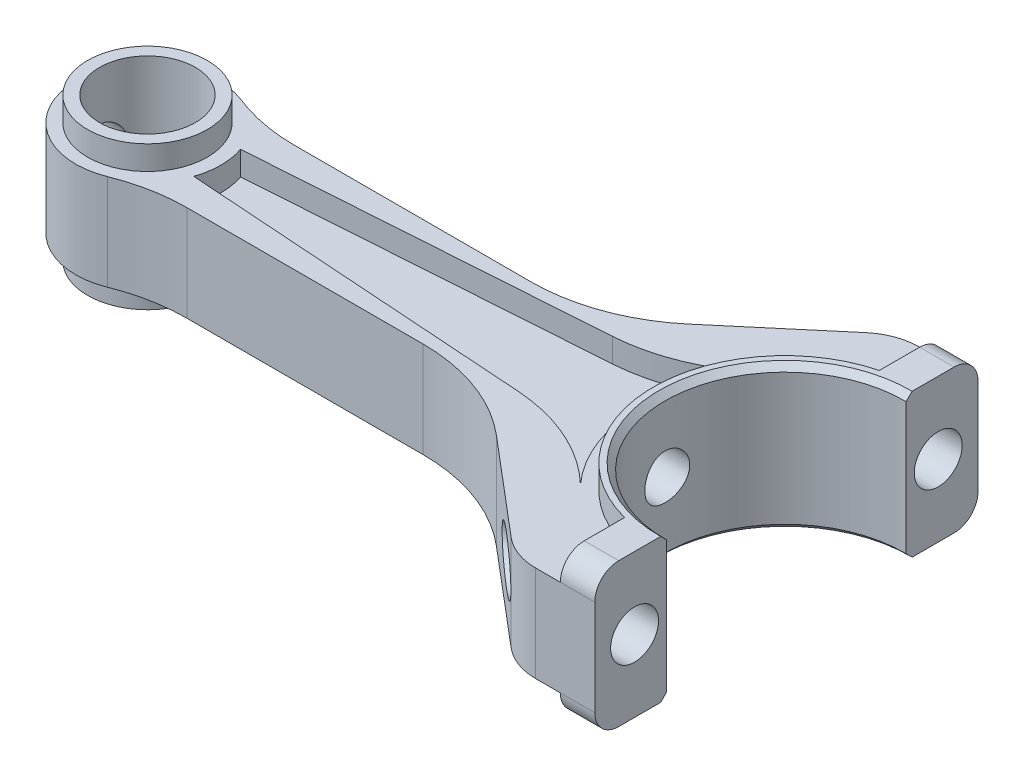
ISO-10303-21;
HEADER;
FILE_DESCRIPTION(('STEP AP214'),'2;1');
FILE_NAME('part.step','',(''),(''),'','','');
FILE_SCHEMA(('AUTOMOTIVE_DESIGN { 1 0 10303 214 1 1 1 1 }'));
ENDSEC;
DATA;
#1=APPLICATION_CONTEXT('core data for automotive mechanical design processes');
#2=APPLICATION_PROTOCOL_DEFINITION('international standard','automotive_design',2000,#1);
#3=PRODUCT_CONTEXT('',#1,'mechanical');
#4=PRODUCT('Part','Part','',(#3));
#5=PRODUCT_RELATED_PRODUCT_CATEGORY('part','',(#4));
#6=PRODUCT_DEFINITION_FORMATION('','',#4);
#7=PRODUCT_DEFINITION_CONTEXT('part definition',#1,'design');
#8=PRODUCT_DEFINITION('design','',#6,#7);
#9=PRODUCT_DEFINITION_SHAPE('','',#8);
#10=(LENGTH_UNIT() NAMED_UNIT(*) SI_UNIT(.MILLI.,.METRE.));
#11=(NAMED_UNIT(*) PLANE_ANGLE_UNIT() SI_UNIT($,.RADIAN.));
#12=(NAMED_UNIT(*) SI_UNIT($,.STERADIAN.) SOLID_ANGLE_UNIT());
#13=UNCERTAINTY_MEASURE_WITH_UNIT(LENGTH_MEASURE(1.E-05),#10,'distance_accuracy_value','');
#14=(GEOMETRIC_REPRESENTATION_CONTEXT(3) GLOBAL_UNCERTAINTY_ASSIGNED_CONTEXT((#13)) GLOBAL_UNIT_ASSIGNED_CONTEXT((#10,
#11,#12)) REPRESENTATION_CONTEXT('',''));
#15=CARTESIAN_POINT('',(0.,0.,0.));
#16=DIRECTION('',(0.,0.,1.));
#17=DIRECTION('',(1.,0.,0.));
#18=AXIS2_PLACEMENT_3D('',#15,#16,#17);
#19=CARTESIAN_POINT('',(71.1571170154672,-11.,0.));
#20=DIRECTION('',(0.,-1.,0.));
#21=DIRECTION('',(0.,0.,-1.));
#22=AXIS2_PLACEMENT_3D('',#19,#20,#21);
#23=CONICAL_SURFACE('',#22,20.,0.785398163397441);
#24=CARTESIAN_POINT('',(71.1571170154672,-12.,0.));
#25=DIRECTION('',(0.,1.,0.));
#26=DIRECTION('',(0.,0.,1.));
#27=AXIS2_PLACEMENT_3D('',#24,#25,#26);
#28=CIRCLE('',#27,21.);
#29=CARTESIAN_POINT('',(71.4071170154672,-12.,-20.9985118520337));
#30=VERTEX_POINT('',#29);
#31=CARTESIAN_POINT('',(71.4071170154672,-12.,20.9985118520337));
#32=VERTEX_POINT('',#31);
#33=EDGE_CURVE('E402',#30,#32,#28,.T.);
#34=ORIENTED_EDGE('',*,*,#33,.F.);
#35=CARTESIAN_POINT('',(71.4071170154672,-37.20734184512,-46.2066655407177));
#36=CARTESIAN_POINT('',(71.4071170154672,-34.0174505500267,-43.0167203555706));
#37=CARTESIAN_POINT('',(71.4071170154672,-30.8275577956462,-39.8267766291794));
#38=CARTESIAN_POINT('',(71.4071170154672,-24.4477930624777,-33.4468683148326));
#39=CARTESIAN_POINT('',(71.4071170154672,-21.2579210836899,-30.2569037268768));
#40=CARTESIAN_POINT('',(71.4071170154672,-16.4731135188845,-25.4718904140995));
#41=CARTESIAN_POINT('',(71.4071170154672,-14.8781612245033,-23.8768583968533));
#42=CARTESIAN_POINT('',(71.4071170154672,-11.6882765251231,-20.6867744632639));
#43=CARTESIAN_POINT('',(71.4071170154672,-10.0933441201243,-19.0917225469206));
#44=CARTESIAN_POINT('',(71.4071170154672,-6.90352420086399,-15.9015738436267));
#45=CARTESIAN_POINT('',(71.4071170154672,-5.30863668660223,-14.3064770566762));
#46=CARTESIAN_POINT('',(71.4071170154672,-2.11895097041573,-11.1161942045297));
#47=CARTESIAN_POINT('',(71.4071170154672,-0.524152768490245,-9.52100813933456));
#48=CARTESIAN_POINT('',(71.4071170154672,1.50767793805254,-7.48816151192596));
#49=CARTESIAN_POINT('',(71.4071170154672,1.94489980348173,-7.05069024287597));
#50=CARTESIAN_POINT('',(71.4071170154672,2.81927803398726,-6.17568448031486));
#51=CARTESIAN_POINT('',(71.4071170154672,3.25643439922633,-5.7381499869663));
#52=CARTESIAN_POINT('',(71.4071170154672,4.27838668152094,-4.71508316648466));
#53=CARTESIAN_POINT('',(71.4071170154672,4.86314364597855,-4.12951189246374));
#54=CARTESIAN_POINT('',(71.4071170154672,5.64306685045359,-3.34763596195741));
#55=CARTESIAN_POINT('',(71.4071170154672,5.83852160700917,-3.15161913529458));
#56=CARTESIAN_POINT('',(71.4071170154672,6.22929766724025,-2.75945252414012));
#57=CARTESIAN_POINT('',(71.4071170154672,6.42461897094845,-2.56330273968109));
#58=CARTESIAN_POINT('',(71.4071170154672,6.7503932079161,-2.23571375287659));
#59=CARTESIAN_POINT('',(71.4071170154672,6.88091783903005,-2.10434585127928));
#60=CARTESIAN_POINT('',(71.4071170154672,7.14176915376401,-1.84141374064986));
#61=CARTESIAN_POINT('',(71.4071170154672,7.27209583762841,-1.7098495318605));
#62=CARTESIAN_POINT('',(71.4071170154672,7.48929298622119,-1.48994009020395));
#63=CARTESIAN_POINT('',(71.4071170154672,7.5762711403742,-1.40170122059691));
#64=CARTESIAN_POINT('',(71.4071170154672,7.74991857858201,-1.22494329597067));
#65=CARTESIAN_POINT('',(71.4071170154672,7.8365879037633,-1.13642428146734));
#66=CARTESIAN_POINT('',(71.4071170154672,7.98074659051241,-0.98821214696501));
#67=CARTESIAN_POINT('',(71.4071170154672,8.03839810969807,-0.928676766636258));
#68=CARTESIAN_POINT('',(71.4071170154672,8.15327860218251,-0.809147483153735));
#69=CARTESIAN_POINT('',(71.4071170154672,8.2105073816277,-0.749153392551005));
#70=CARTESIAN_POINT('',(71.4071170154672,8.30531554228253,-0.648284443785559));
#71=CARTESIAN_POINT('',(71.4071170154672,8.34314070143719,-0.607640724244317));
#72=CARTESIAN_POINT('',(71.4071170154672,8.41805927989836,-0.525772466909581));
#73=CARTESIAN_POINT('',(71.4071170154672,8.45515357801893,-0.484548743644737));
#74=CARTESIAN_POINT('',(71.4071170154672,8.51465171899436,-0.416207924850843));
#75=CARTESIAN_POINT('',(71.4071170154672,8.53746477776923,-0.389448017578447));
#76=CARTESIAN_POINT('',(71.4071170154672,8.58225272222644,-0.335049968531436));
#77=CARTESIAN_POINT('',(71.4071170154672,8.6042241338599,-0.307408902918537));
#78=CARTESIAN_POINT('',(71.4071170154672,8.6359495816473,-0.264804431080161));
#79=CARTESIAN_POINT('',(71.4071170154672,8.6463674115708,-0.250338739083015));
#80=CARTESIAN_POINT('',(71.4071170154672,8.66652904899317,-0.220948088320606));
#81=CARTESIAN_POINT('',(71.4071170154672,8.67627312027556,-0.20602331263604));
#82=CARTESIAN_POINT('',(71.4071170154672,8.69472032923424,-0.175616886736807));
#83=CARTESIAN_POINT('',(71.4071170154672,8.70342760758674,-0.160137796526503));
#84=CARTESIAN_POINT('',(71.4071170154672,8.71928341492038,-0.128414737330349));
#85=CARTESIAN_POINT('',(71.4071170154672,8.72643493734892,-0.11217231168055));
#86=CARTESIAN_POINT('',(71.4071170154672,8.73839161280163,-0.0786433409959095));
#87=CARTESIAN_POINT('',(71.4071170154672,8.74317681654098,-0.0613492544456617));
#88=CARTESIAN_POINT('',(71.4071170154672,8.74921285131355,-0.0262196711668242));
#89=CARTESIAN_POINT('',(71.4071170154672,8.75048641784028,-0.00838841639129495));
#90=CARTESIAN_POINT('',(71.4071170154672,8.74916181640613,0.0271472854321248));
#91=CARTESIAN_POINT('',(71.4071170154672,8.74655698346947,0.0448514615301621));
#92=CARTESIAN_POINT('',(71.4071170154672,8.7381951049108,0.079569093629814));
#93=CARTESIAN_POINT('',(71.4071170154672,8.73241604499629,0.0965768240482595));
#94=CARTESIAN_POINT('',(71.4071170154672,8.71720355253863,0.133491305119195));
#95=CARTESIAN_POINT('',(71.4071170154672,8.707235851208,0.153167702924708));
#96=CARTESIAN_POINT('',(71.4071170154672,8.68547633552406,0.191503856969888));
#97=CARTESIAN_POINT('',(71.4071170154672,8.67367991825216,0.21016088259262));
#98=CARTESIAN_POINT('',(71.4071170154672,8.64892303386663,0.246858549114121));
#99=CARTESIAN_POINT('',(71.4071170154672,8.63595524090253,0.264894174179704));
#100=CARTESIAN_POINT('',(71.4071170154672,8.6093426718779,0.300415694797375));
#101=CARTESIAN_POINT('',(71.4071170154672,8.59569879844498,0.317902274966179));
#102=CARTESIAN_POINT('',(71.4071170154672,8.54973157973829,0.375269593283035));
#103=CARTESIAN_POINT('',(71.4071170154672,8.51643488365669,0.414364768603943));
#104=CARTESIAN_POINT('',(71.4071170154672,8.44876753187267,0.491618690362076));
#105=CARTESIAN_POINT('',(71.4071170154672,8.41439643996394,0.52977704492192));
#106=CARTESIAN_POINT('',(71.4071170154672,8.34500875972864,0.605597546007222));
#107=CARTESIAN_POINT('',(71.4071170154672,8.3099913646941,0.64325895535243));
#108=CARTESIAN_POINT('',(71.4071170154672,8.23960509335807,0.718236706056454));
#109=CARTESIAN_POINT('',(71.4071170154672,8.20423628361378,0.755553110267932));
#110=CARTESIAN_POINT('',(71.4071170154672,8.09815003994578,0.866798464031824));
#111=CARTESIAN_POINT('',(71.4071170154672,8.02709638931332,0.940406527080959));
#112=CARTESIAN_POINT('',(71.4071170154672,7.88460627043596,1.0871500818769));
#113=CARTESIAN_POINT('',(71.4071170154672,7.81317010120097,1.16028586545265));
#114=CARTESIAN_POINT('',(71.4071170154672,7.59869506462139,1.37913888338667));
#115=CARTESIAN_POINT('',(71.4071170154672,7.45529551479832,1.5245025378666));
#116=CARTESIAN_POINT('',(71.4071170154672,7.16811895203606,1.81485815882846));
#117=CARTESIAN_POINT('',(71.4071170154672,7.02434193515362,1.95985012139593));
#118=CARTESIAN_POINT('',(71.4071170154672,6.73654504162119,2.2496723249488));
#119=CARTESIAN_POINT('',(71.4071170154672,6.59252510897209,2.39450251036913));
#120=CARTESIAN_POINT('',(71.4071170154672,6.30437069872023,2.68404771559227));
#121=CARTESIAN_POINT('',(71.4071170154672,6.16023622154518,2.82876273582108));
#122=CARTESIAN_POINT('',(71.4071170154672,5.72728981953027,3.26324022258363));
#123=CARTESIAN_POINT('',(71.4071170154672,5.43837123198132,3.55289640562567));
#124=CARTESIAN_POINT('',(71.4071170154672,4.86043029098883,4.13205369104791));
#125=CARTESIAN_POINT('',(71.4071170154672,4.57140794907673,4.42155480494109));
#126=CARTESIAN_POINT('',(71.4071170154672,3.70446929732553,5.28971870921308));
#127=CARTESIAN_POINT('',(71.4071170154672,3.12644765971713,5.86827632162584));
#128=CARTESIAN_POINT('',(71.4071170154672,1.97029876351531,7.0252861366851));
#129=CARTESIAN_POINT('',(71.4071170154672,1.39217150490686,7.60373833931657));
#130=CARTESIAN_POINT('',(71.4071170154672,-0.342328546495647,9.33905370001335));
#131=CARTESIAN_POINT('',(71.4071170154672,-1.49878113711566,10.4958371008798));
#132=CARTESIAN_POINT('',(71.4071170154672,-3.81081552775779,12.8083963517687));
#133=CARTESIAN_POINT('',(71.4071170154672,-4.96639727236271,13.9641722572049));
#134=CARTESIAN_POINT('',(71.4071170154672,-7.27758522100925,16.2756769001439));
#135=CARTESIAN_POINT('',(71.4071170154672,-8.43319142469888,17.4314056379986));
#136=CARTESIAN_POINT('',(71.4071170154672,-11.8888157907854,20.887342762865));
#137=CARTESIAN_POINT('',(71.4071170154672,-14.188860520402,23.1875245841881));
#138=CARTESIAN_POINT('',(71.4071170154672,-18.7889862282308,27.7878700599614));
#139=CARTESIAN_POINT('',(71.4071170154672,-21.0890672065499,30.0880337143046));
#140=CARTESIAN_POINT('',(71.4071170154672,-25.692180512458,34.6912844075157));
#141=CARTESIAN_POINT('',(71.4071170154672,-27.9952128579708,36.9943714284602));
#142=CARTESIAN_POINT('',(71.4071170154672,-32.6012769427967,41.6005279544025));
#143=CARTESIAN_POINT('',(71.4071170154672,-34.9043086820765,43.9035974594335));
#144=CARTESIAN_POINT('',(71.4071170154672,-37.20734184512,46.2066655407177));
#145=B_SPLINE_CURVE_WITH_KNOTS('',3,(#35,#36,#37,#38,#39,#40,#41,#42,#43,#44,#45,#46,#47,#48,
#49,#50,#51,#52,#53,#54,#55,#56,#57,#58,#59,#60,#61,#62,#63,#64,#65,#66,#67,#68,#69,#70,#71,#72,
#73,#74,#75,#76,#77,#78,#79,#80,#81,#82,#83,#84,#85,#86,#87,#88,#89,#90,#91,#92,#93,#94,#95,#96,
#97,#98,#99,#100,#101,#102,#103,#104,#105,#106,#107,#108,#109,#110,#111,#112,#113,#114,#115,
#116,#117,#118,#119,#120,#121,#122,#123,#124,#125,#126,#127,#128,#129,#130,#131,#132,#133,#134,
#135,#136,#137,#138,#139,#140,#141,#142,#143,#144),.UNSPECIFIED.,.F.,.F.,(4,2,2,2,2,2,2,2,2,2,2,
2,2,2,2,2,2,2,2,2,2,2,2,2,2,2,2,2,2,2,2,2,2,2,2,2,2,2,2,2,2,2,2,2,2,2,2,2,2,2,2,2,2,2,4),(0.,
13.5336769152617,27.0673540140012,33.8343326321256,40.6013112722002,47.3682898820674,
54.1352684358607,55.9907728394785,57.8462725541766,60.3289139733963,61.1593514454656,
61.9897887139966,62.5453495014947,63.1009096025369,63.4726104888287,63.844259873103,
64.09288234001,64.3416125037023,64.5081752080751,64.6745236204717,64.7800087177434,
64.8858904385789,64.9393577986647,64.9928041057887,65.0460292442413,65.099151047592,
65.1527133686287,65.2059280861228,65.2592343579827,65.3129150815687,65.3789141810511,
65.4450821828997,65.5116972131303,65.5782255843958,65.7322264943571,65.8862907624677,
66.040562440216,66.1948054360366,66.5017220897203,66.808426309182,67.4209969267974,
68.0335739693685,68.6463197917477,69.2590633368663,70.4864066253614,71.7136406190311,
74.1671159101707,76.6205915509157,81.5277061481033,86.4308361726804,91.3339180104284,
101.092472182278,110.851064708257,120.622119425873,130.393135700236),.UNSPECIFIED.);
#146=CARTESIAN_POINT('',(71.4071170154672,-11.,-19.9984374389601));
#147=VERTEX_POINT('',#146);
#148=EDGE_CURVE('E61',#30,#147,#145,.T.);
#149=ORIENTED_EDGE('',*,*,#148,.T.);
#150=CARTESIAN_POINT('',(71.1571170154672,-11.,0.));
#151=DIRECTION('',(0.,1.,0.));
#152=DIRECTION('',(0.,0.,1.));
#153=AXIS2_PLACEMENT_3D('',#150,#151,#152);
#154=CIRCLE('',#153,20.);
#155=CARTESIAN_POINT('',(71.4071170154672,-11.,19.9984374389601));
#156=VERTEX_POINT('',#155);
#157=EDGE_CURVE('E389',#156,#147,#154,.F.);
#158=ORIENTED_EDGE('',*,*,#157,.F.);
#159=EDGE_CURVE('E490',#156,#32,#145,.T.);
#160=ORIENTED_EDGE('',*,*,#159,.T.);
#161=EDGE_LOOP('',(#34,#149,#158,#160));
#162=FACE_BOUND('',#161,.T.);
#163=ADVANCED_FACE('F40',(#162),#23,.F.);
#164=CARTESIAN_POINT('',(71.1571170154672,12.,0.));
#165=DIRECTION('',(0.,1.,0.));
#166=DIRECTION('',(0.,0.,1.));
#167=AXIS2_PLACEMENT_3D('',#164,#165,#166);
#168=CONICAL_SURFACE('',#167,21.,0.785398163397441);
#169=CARTESIAN_POINT('',(71.1571170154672,12.,0.));
#170=DIRECTION('',(0.,1.,0.));
#171=DIRECTION('',(0.,0.,1.));
#172=AXIS2_PLACEMENT_3D('',#169,#170,#171);
#173=CIRCLE('',#172,21.);
#174=CARTESIAN_POINT('',(71.4071170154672,12.,20.9985118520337));
#175=VERTEX_POINT('',#174);
#176=CARTESIAN_POINT('',(71.4071170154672,12.,-20.9985118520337));
#177=VERTEX_POINT('',#176);
#178=EDGE_CURVE('E348',#175,#177,#173,.F.);
#179=ORIENTED_EDGE('',*,*,#178,.F.);
#180=CARTESIAN_POINT('',(71.4071170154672,37.20734184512,46.2066655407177));
#181=CARTESIAN_POINT('',(71.4071170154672,34.0174505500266,43.0167203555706));
#182=CARTESIAN_POINT('',(71.4071170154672,30.8275577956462,39.8267766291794));
#183=CARTESIAN_POINT('',(71.4071170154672,24.4477930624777,33.4468683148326));
#184=CARTESIAN_POINT('',(71.4071170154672,21.2579210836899,30.2569037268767));
#185=CARTESIAN_POINT('',(71.4071170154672,16.4731135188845,25.4718904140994));
#186=CARTESIAN_POINT('',(71.4071170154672,14.8781612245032,23.8768583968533));
#187=CARTESIAN_POINT('',(71.4071170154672,11.6882765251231,20.6867744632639));
#188=CARTESIAN_POINT('',(71.4071170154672,10.0933441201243,19.0917225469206));
#189=CARTESIAN_POINT('',(71.4071170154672,6.90352420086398,15.9015738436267));
#190=CARTESIAN_POINT('',(71.4071170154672,5.30863668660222,14.3064770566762));
#191=CARTESIAN_POINT('',(71.4071170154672,2.11895097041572,11.1161942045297));
#192=CARTESIAN_POINT('',(71.4071170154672,0.524152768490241,9.52100813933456));
#193=CARTESIAN_POINT('',(71.4071170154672,-1.50767793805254,7.48816151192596));
#194=CARTESIAN_POINT('',(71.4071170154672,-1.94489980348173,7.05069024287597));
#195=CARTESIAN_POINT('',(71.4071170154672,-2.81927803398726,6.17568448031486));
#196=CARTESIAN_POINT('',(71.4071170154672,-3.25643439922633,5.7381499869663));
#197=CARTESIAN_POINT('',(71.4071170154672,-4.27838668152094,4.71508316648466));
#198=CARTESIAN_POINT('',(71.4071170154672,-4.86314364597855,4.12951189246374));
#199=CARTESIAN_POINT('',(71.4071170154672,-5.64306685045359,3.34763596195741));
#200=CARTESIAN_POINT('',(71.4071170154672,-5.83852160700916,3.15161913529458));
#201=CARTESIAN_POINT('',(71.4071170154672,-6.22929766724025,2.75945252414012));
#202=CARTESIAN_POINT('',(71.4071170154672,-6.42461897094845,2.56330273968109));
#203=CARTESIAN_POINT('',(71.4071170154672,-6.7503932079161,2.23571375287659));
#204=CARTESIAN_POINT('',(71.4071170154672,-6.88091783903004,2.10434585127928));
#205=CARTESIAN_POINT('',(71.4071170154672,-7.141769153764,1.84141374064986));
#206=CARTESIAN_POINT('',(71.4071170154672,-7.27209583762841,1.7098495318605));
#207=CARTESIAN_POINT('',(71.4071170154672,-7.48929298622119,1.48994009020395));
#208=CARTESIAN_POINT('',(71.4071170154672,-7.57627114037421,1.40170122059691));
#209=CARTESIAN_POINT('',(71.4071170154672,-7.74991857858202,1.22494329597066));
#210=CARTESIAN_POINT('',(71.4071170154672,-7.8365879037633,1.13642428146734));
#211=CARTESIAN_POINT('',(71.4071170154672,-7.9807465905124,0.988212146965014));
#212=CARTESIAN_POINT('',(71.4071170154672,-8.03839810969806,0.928676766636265));
#213=CARTESIAN_POINT('',(71.4071170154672,-8.1532786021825,0.809147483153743));
#214=CARTESIAN_POINT('',(71.4071170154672,-8.21050738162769,0.749153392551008));
#215=CARTESIAN_POINT('',(71.4071170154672,-8.30531554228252,0.648284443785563));
#216=CARTESIAN_POINT('',(71.4071170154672,-8.34314070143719,0.607640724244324));
#217=CARTESIAN_POINT('',(71.4071170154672,-8.41805927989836,0.525772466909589));
#218=CARTESIAN_POINT('',(71.4071170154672,-8.45515357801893,0.484548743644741));
#219=CARTESIAN_POINT('',(71.4071170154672,-8.51465171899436,0.41620792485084));
#220=CARTESIAN_POINT('',(71.4071170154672,-8.53746477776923,0.38944801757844));
#221=CARTESIAN_POINT('',(71.4071170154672,-8.58225272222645,0.33504996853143));
#222=CARTESIAN_POINT('',(71.4071170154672,-8.60422413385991,0.307408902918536));
#223=CARTESIAN_POINT('',(71.4071170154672,-8.63594958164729,0.264804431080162));
#224=CARTESIAN_POINT('',(71.4071170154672,-8.64636741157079,0.250338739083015));
#225=CARTESIAN_POINT('',(71.4071170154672,-8.66652904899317,0.220948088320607));
#226=CARTESIAN_POINT('',(71.4071170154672,-8.67627312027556,0.206023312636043));
#227=CARTESIAN_POINT('',(71.4071170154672,-8.69472032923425,0.175616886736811));
#228=CARTESIAN_POINT('',(71.4071170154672,-8.70342760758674,0.160137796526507));
#229=CARTESIAN_POINT('',(71.4071170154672,-8.71928341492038,0.128414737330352));
#230=CARTESIAN_POINT('',(71.4071170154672,-8.72643493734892,0.112172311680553));
#231=CARTESIAN_POINT('',(71.4071170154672,-8.73839161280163,0.0786433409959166));
#232=CARTESIAN_POINT('',(71.4071170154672,-8.74317681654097,0.061349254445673));
#233=CARTESIAN_POINT('',(71.4071170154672,-8.74921285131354,0.0262196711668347));
#234=CARTESIAN_POINT('',(71.4071170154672,-8.75048641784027,0.00838841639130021));
#235=CARTESIAN_POINT('',(71.4071170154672,-8.74916181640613,-0.027147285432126));
#236=CARTESIAN_POINT('',(71.4071170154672,-8.74655698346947,-0.0448514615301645));
#237=CARTESIAN_POINT('',(71.4071170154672,-8.73819510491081,-0.0795690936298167));
#238=CARTESIAN_POINT('',(71.4071170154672,-8.7324160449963,-0.0965768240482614));
#239=CARTESIAN_POINT('',(71.4071170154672,-8.71720355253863,-0.133491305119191));
#240=CARTESIAN_POINT('',(71.4071170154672,-8.707235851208,-0.153167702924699));
#241=CARTESIAN_POINT('',(71.4071170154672,-8.68547633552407,-0.191503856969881));
#242=CARTESIAN_POINT('',(71.4071170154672,-8.67367991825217,-0.210160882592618));
#243=CARTESIAN_POINT('',(71.4071170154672,-8.64892303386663,-0.246858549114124));
#244=CARTESIAN_POINT('',(71.4071170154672,-8.63595524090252,-0.264894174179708));
#245=CARTESIAN_POINT('',(71.4071170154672,-8.60934267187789,-0.30041569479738));
#246=CARTESIAN_POINT('',(71.4071170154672,-8.59569879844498,-0.317902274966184));
#247=CARTESIAN_POINT('',(71.4071170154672,-8.54973157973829,-0.37526959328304));
#248=CARTESIAN_POINT('',(71.4071170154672,-8.51643488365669,-0.414364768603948));
#249=CARTESIAN_POINT('',(71.4071170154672,-8.44876753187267,-0.491618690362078));
#250=CARTESIAN_POINT('',(71.4071170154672,-8.41439643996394,-0.529777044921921));
#251=CARTESIAN_POINT('',(71.4071170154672,-8.34500875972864,-0.605597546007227));
#252=CARTESIAN_POINT('',(71.4071170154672,-8.30999136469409,-0.643258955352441));
#253=CARTESIAN_POINT('',(71.4071170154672,-8.23960509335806,-0.718236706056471));
#254=CARTESIAN_POINT('',(71.4071170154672,-8.20423628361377,-0.755553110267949));
#255=CARTESIAN_POINT('',(71.4071170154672,-8.09815003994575,-0.866798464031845));
#256=CARTESIAN_POINT('',(71.4071170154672,-8.0270963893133,-0.940406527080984));
#257=CARTESIAN_POINT('',(71.4071170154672,-7.88460627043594,-1.08715008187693));
#258=CARTESIAN_POINT('',(71.4071170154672,-7.81317010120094,-1.16028586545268));
#259=CARTESIAN_POINT('',(71.4071170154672,-7.59869506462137,-1.3791388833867));
#260=CARTESIAN_POINT('',(71.4071170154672,-7.45529551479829,-1.52450253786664));
#261=CARTESIAN_POINT('',(71.4071170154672,-7.16811895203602,-1.8148581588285));
#262=CARTESIAN_POINT('',(71.4071170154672,-7.02434193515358,-1.95985012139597));
#263=CARTESIAN_POINT('',(71.4071170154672,-6.73654504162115,-2.24967232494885));
#264=CARTESIAN_POINT('',(71.4071170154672,-6.59252510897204,-2.39450251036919));
#265=CARTESIAN_POINT('',(71.4071170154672,-6.30437069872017,-2.68404771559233));
#266=CARTESIAN_POINT('',(71.4071170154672,-6.16023622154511,-2.82876273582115));
#267=CARTESIAN_POINT('',(71.4071170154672,-5.7272898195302,-3.2632402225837));
#268=CARTESIAN_POINT('',(71.4071170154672,-5.43837123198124,-3.55289640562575));
#269=CARTESIAN_POINT('',(71.4071170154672,-4.86043029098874,-4.13205369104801));
#270=CARTESIAN_POINT('',(71.4071170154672,-4.57140794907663,-4.42155480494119));
#271=CARTESIAN_POINT('',(71.4071170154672,-3.70446929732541,-5.28971870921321));
#272=CARTESIAN_POINT('',(71.4071170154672,-3.126447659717,-5.86827632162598));
#273=CARTESIAN_POINT('',(71.4071170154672,-1.97029876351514,-7.02528613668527));
#274=CARTESIAN_POINT('',(71.4071170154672,-1.39217150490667,-7.60373833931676));
#275=CARTESIAN_POINT('',(71.4071170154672,0.342328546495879,-9.33905370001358));
#276=CARTESIAN_POINT('',(71.4071170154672,1.49878113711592,-10.4958371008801));
#277=CARTESIAN_POINT('',(71.4071170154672,3.8108155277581,-12.808396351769));
#278=CARTESIAN_POINT('',(71.4071170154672,4.96639727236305,-13.9641722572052));
#279=CARTESIAN_POINT('',(71.4071170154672,7.27758522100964,-16.2756769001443));
#280=CARTESIAN_POINT('',(71.4071170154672,8.4331914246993,-17.431405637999));
#281=CARTESIAN_POINT('',(71.4071170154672,11.8888157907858,-20.8873427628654));
#282=CARTESIAN_POINT('',(71.4071170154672,14.1888605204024,-23.1875245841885));
#283=CARTESIAN_POINT('',(71.4071170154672,18.7889862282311,-27.7878700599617));
#284=CARTESIAN_POINT('',(71.4071170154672,21.0890672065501,-30.0880337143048));
#285=CARTESIAN_POINT('',(71.4071170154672,25.6921805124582,-34.6912844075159));
#286=CARTESIAN_POINT('',(71.4071170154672,27.9952128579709,-36.9943714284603));
#287=CARTESIAN_POINT('',(71.4071170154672,32.6012769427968,-41.6005279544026));
#288=CARTESIAN_POINT('',(71.4071170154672,34.9043086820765,-43.9035974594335));
#289=CARTESIAN_POINT('',(71.4071170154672,37.20734184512,-46.2066655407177));
#290=B_SPLINE_CURVE_WITH_KNOTS('',3,(#180,#181,#182,#183,#184,#185,#186,#187,#188,#189,#190,
#191,#192,#193,#194,#195,#196,#197,#198,#199,#200,#201,#202,#203,#204,#205,#206,#207,#208,#209,
#210,#211,#212,#213,#214,#215,#216,#217,#218,#219,#220,#221,#222,#223,#224,#225,#226,#227,#228,
#229,#230,#231,#232,#233,#234,#235,#236,#237,#238,#239,#240,#241,#242,#243,#244,#245,#246,#247,
#248,#249,#250,#251,#252,#253,#254,#255,#256,#257,#258,#259,#260,#261,#262,#263,#264,#265,#266,
#267,#268,#269,#270,#271,#272,#273,#274,#275,#276,#277,#278,#279,#280,#281,#282,#283,#284,#285,
#286,#287,#288,#289),.UNSPECIFIED.,.F.,.F.,(4,2,2,2,2,2,2,2,2,2,2,2,2,2,2,2,2,2,2,2,2,2,2,2,2,2,
2,2,2,2,2,2,2,2,2,2,2,2,2,2,2,2,2,2,2,2,2,2,2,2,2,2,2,2,4),(0.,13.5336769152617,
27.0673540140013,33.8343326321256,40.6013112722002,47.3682898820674,54.1352684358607,
55.9907728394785,57.8462725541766,60.3289139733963,61.1593514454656,61.9897887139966,
62.5453495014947,63.1009096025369,63.4726104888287,63.844259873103,64.09288234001,
64.3416125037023,64.5081752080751,64.6745236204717,64.7800087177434,64.8858904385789,
64.9393577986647,64.9928041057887,65.0460292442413,65.099151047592,65.1527133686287,
65.2059280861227,65.2592343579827,65.3129150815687,65.378914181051,65.4450821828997,
65.5116972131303,65.5782255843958,65.7322264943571,65.8862907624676,66.040562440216,
66.1948054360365,66.5017220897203,66.808426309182,67.4209969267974,68.0335739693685,
68.6463197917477,69.2590633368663,70.4864066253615,71.7136406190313,74.1671159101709,
76.6205915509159,81.5277061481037,86.4308361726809,91.333918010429,101.092472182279,
110.851064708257,120.622119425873,130.393135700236),.UNSPECIFIED.);
#291=CARTESIAN_POINT('',(71.4071170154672,11.,19.9984374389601));
#292=VERTEX_POINT('',#291);
#293=EDGE_CURVE('E95',#175,#292,#290,.T.);
#294=ORIENTED_EDGE('',*,*,#293,.T.);
#295=CARTESIAN_POINT('',(71.1571170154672,11.,0.));
#296=DIRECTION('',(0.,1.,0.));
#297=DIRECTION('',(0.,0.,1.));
#298=AXIS2_PLACEMENT_3D('',#295,#296,#297);
#299=CIRCLE('',#298,20.);
#300=CARTESIAN_POINT('',(71.4071170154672,11.,-19.9984374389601));
#301=VERTEX_POINT('',#300);
#302=EDGE_CURVE('E384',#301,#292,#299,.T.);
#303=ORIENTED_EDGE('',*,*,#302,.F.);
#304=EDGE_CURVE('E497',#301,#177,#290,.T.);
#305=ORIENTED_EDGE('',*,*,#304,.T.);
#306=EDGE_LOOP('',(#179,#294,#303,#305));
#307=FACE_BOUND('',#306,.T.);
#308=ADVANCED_FACE('F476',(#307),#168,.F.);
#309=CARTESIAN_POINT('',(38.8878880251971,0.,-25.3535661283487));
#310=DIRECTION('',(1.,0.,0.));
#311=DIRECTION('',(0.,0.,-1.));
#312=AXIS2_PLACEMENT_3D('',#309,#310,#311);
#313=CYLINDRICAL_SURFACE('',#312,4.);
#314=CARTESIAN_POINT('',(50.0209089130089,0.,-25.3535661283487));
#315=DIRECTION('',(0.645899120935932,0.,0.763422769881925));
#316=DIRECTION('',(0.763422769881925,0.,-0.645899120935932));
#317=AXIS2_PLACEMENT_3D('',#314,#315,#316);
#318=ELLIPSE('',#317,6.19291754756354,4.);
#319=CARTESIAN_POINT('',(54.7487231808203,0.,-29.3535661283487));
#320=VERTEX_POINT('',#319);
#321=EDGE_CURVE('E376',#320,#320,#318,.T.);
#322=ORIENTED_EDGE('',*,*,#321,.F.);
#323=EDGE_LOOP('',(#322));
#324=FACE_BOUND('',#323,.T.);
#325=CARTESIAN_POINT('',(71.4071170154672,0.,-25.3535661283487));
#326=DIRECTION('',(1.,0.,0.));
#327=DIRECTION('',(0.,0.,-1.));
#328=AXIS2_PLACEMENT_3D('',#325,#326,#327);
#329=CIRCLE('',#328,4.);
#330=CARTESIAN_POINT('',(71.4071170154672,0.,-29.3535661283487));
#331=VERTEX_POINT('',#330);
#332=EDGE_CURVE('E722',#331,#331,#329,.F.);
#333=ORIENTED_EDGE('',*,*,#332,.F.);
#334=EDGE_LOOP('',(#333));
#335=FACE_BOUND('',#334,.T.);
#336=ADVANCED_FACE('F424',(#324,#335),#313,.F.);
#337=CARTESIAN_POINT('',(38.8878880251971,0.,25.3535661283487));
#338=DIRECTION('',(1.,0.,0.));
#339=DIRECTION('',(0.,0.,-1.));
#340=AXIS2_PLACEMENT_3D('',#337,#338,#339);
#341=CYLINDRICAL_SURFACE('',#340,4.);
#342=CARTESIAN_POINT('',(50.0209089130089,0.,25.3535661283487));
#343=DIRECTION('',(0.645899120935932,0.,-0.763422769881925));
#344=DIRECTION('',(0.763422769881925,0.,0.645899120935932));
#345=AXIS2_PLACEMENT_3D('',#342,#343,#344);
#346=ELLIPSE('',#345,6.19291754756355,4.);
#347=CARTESIAN_POINT('',(54.7487231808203,0.,29.3535661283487));
#348=VERTEX_POINT('',#347);
#349=EDGE_CURVE('E371',#348,#348,#346,.T.);
#350=ORIENTED_EDGE('',*,*,#349,.F.);
#351=EDGE_LOOP('',(#350));
#352=FACE_BOUND('',#351,.T.);
#353=CARTESIAN_POINT('',(71.4071170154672,0.,25.3535661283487));
#354=DIRECTION('',(1.,0.,0.));
#355=DIRECTION('',(0.,0.,-1.));
#356=AXIS2_PLACEMENT_3D('',#353,#354,#355);
#357=CIRCLE('',#356,4.);
#358=CARTESIAN_POINT('',(71.4071170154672,0.,21.3535661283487));
#359=VERTEX_POINT('',#358);
#360=EDGE_CURVE('E44',#359,#359,#357,.F.);
#361=ORIENTED_EDGE('',*,*,#360,.F.);
#362=EDGE_LOOP('',(#361));
#363=FACE_BOUND('',#362,.T.);
#364=ADVANCED_FACE('F506',(#352,#363),#341,.F.);
#365=CARTESIAN_POINT('',(61.5394433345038,-8.,-22.));
#366=DIRECTION('',(0.,1.,0.));
#367=DIRECTION('',(0.,0.,1.));
#368=AXIS2_PLACEMENT_3D('',#365,#366,#367);
#369=PLANE('',#368);
#370=CARTESIAN_POINT('',(-35.2919357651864,-8.,0.));
#371=DIRECTION('',(0.,1.,0.));
#372=DIRECTION('',(0.,0.,1.));
#373=AXIS2_PLACEMENT_3D('',#370,#371,#372);
#374=CIRCLE('',#373,9.99999999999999);
#375=CARTESIAN_POINT('',(-35.2919357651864,-8.,9.99999999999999));
#376=VERTEX_POINT('',#375);
#377=EDGE_CURVE('E643',#376,#376,#374,.T.);
#378=ORIENTED_EDGE('',*,*,#377,.T.);
#379=EDGE_LOOP('',(#378));
#380=FACE_BOUND('',#379,.T.);
#381=CARTESIAN_POINT('',(-35.2919357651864,-8.,0.));
#382=DIRECTION('',(0.,-1.,0.));
#383=DIRECTION('',(0.,0.,-1.));
#384=AXIS2_PLACEMENT_3D('',#381,#382,#383);
#385=CIRCLE('',#384,12.2794663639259);
#386=CARTESIAN_POINT('',(-23.6531534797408,-8.,-3.91459334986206));
#387=VERTEX_POINT('',#386);
#388=CARTESIAN_POINT('',(-23.651957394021,-8.,3.91103537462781));
#389=VERTEX_POINT('',#388);
#390=EDGE_CURVE('E630',#387,#389,#385,.T.);
#391=ORIENTED_EDGE('',*,*,#390,.T.);
#392=DIRECTION('',(0.997653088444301,0.,0.0684712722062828));
#393=VECTOR('',#392,1.);
#394=CARTESIAN_POINT('',(-0.378052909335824,-8.,5.50837804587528));
#395=LINE('',#394,#393);
#396=CARTESIAN_POINT('',(34.4866870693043,-8.,7.90122695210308));
#397=VERTEX_POINT('',#396);
#398=EDGE_CURVE('E626',#389,#397,#395,.T.);
#399=ORIENTED_EDGE('',*,*,#398,.T.);
#400=CARTESIAN_POINT('',(32.4325489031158,-8.,37.8308196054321));
#401=DIRECTION('',(0.,-1.,0.));
#402=DIRECTION('',(0.,0.,-1.));
#403=AXIS2_PLACEMENT_3D('',#400,#401,#402);
#404=CIRCLE('',#403,30.);
#405=CARTESIAN_POINT('',(53.1700486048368,-8.,16.152348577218));
#406=VERTEX_POINT('',#405);
#407=EDGE_CURVE('E619',#406,#397,#404,.F.);
#408=ORIENTED_EDGE('',*,*,#407,.F.);
#409=CARTESIAN_POINT('',(71.1571170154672,-8.,0.));
#410=DIRECTION('',(0.,-1.,0.));
#411=DIRECTION('',(0.,0.,-1.));
#412=AXIS2_PLACEMENT_3D('',#409,#410,#411);
#413=CIRCLE('',#412,24.1750490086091);
#414=CARTESIAN_POINT('',(53.8611157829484,-8.,-16.8902734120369));
#415=VERTEX_POINT('',#414);
#416=EDGE_CURVE('E629',#406,#415,#413,.T.);
#417=ORIENTED_EDGE('',*,*,#416,.T.);
#418=CARTESIAN_POINT('',(32.3976624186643,-8.,-37.8502392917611));
#419=DIRECTION('',(0.,-1.,0.));
#420=DIRECTION('',(0.,0.,-1.));
#421=AXIS2_PLACEMENT_3D('',#418,#419,#420);
#422=CIRCLE('',#421,30.);
#423=CARTESIAN_POINT('',(34.4611169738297,-8.,-7.92128750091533));
#424=VERTEX_POINT('',#423);
#425=EDGE_CURVE('E635',#415,#424,#422,.T.);
#426=ORIENTED_EDGE('',*,*,#425,.T.);
#427=DIRECTION('',(0.997631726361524,0.,-0.0687818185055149));
#428=VECTOR('',#427,1.);
#429=CARTESIAN_POINT('',(-0.38051680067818,-8.,-5.51912759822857));
#430=LINE('',#429,#428);
#431=EDGE_CURVE('E610',#387,#424,#430,.T.);
#432=ORIENTED_EDGE('',*,*,#431,.F.);
#433=EDGE_LOOP('',(#391,#399,#408,#417,#426,#432));
#434=FACE_BOUND('',#433,.T.);
#435=DIRECTION('',(0.,0.,-1.));
#436=VECTOR('',#435,1.);
#437=CARTESIAN_POINT('',(65.6571170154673,-8.,-22.));
#438=LINE('',#437,#436);
#439=CARTESIAN_POINT('',(65.6571170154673,-8.,-21.2706938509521));
#440=VERTEX_POINT('',#439);
#441=CARTESIAN_POINT('',(65.6571170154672,-8.,-32.));
#442=VERTEX_POINT('',#441);
#443=EDGE_CURVE('E353',#440,#442,#438,.T.);
#444=ORIENTED_EDGE('',*,*,#443,.F.);
#445=CARTESIAN_POINT('',(71.1571170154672,-8.,0.));
#446=DIRECTION('',(0.,1.,0.));
#447=DIRECTION('',(0.,0.,1.));
#448=AXIS2_PLACEMENT_3D('',#445,#446,#447);
#449=CIRCLE('',#448,21.9702621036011);
#450=CARTESIAN_POINT('',(65.6571170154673,-8.,21.2706938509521));
#451=VERTEX_POINT('',#450);
#452=EDGE_CURVE('E602',#451,#440,#449,.F.);
#453=ORIENTED_EDGE('',*,*,#452,.F.);
#454=DIRECTION('',(0.,0.,-1.));
#455=VECTOR('',#454,1.);
#456=CARTESIAN_POINT('',(65.6571170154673,-8.,-22.));
#457=LINE('',#456,#455);
#458=CARTESIAN_POINT('',(65.6571170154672,-8.,32.));
#459=VERTEX_POINT('',#458);
#460=EDGE_CURVE('E327',#459,#451,#457,.T.);
#461=ORIENTED_EDGE('',*,*,#460,.F.);
#462=DIRECTION('',(1.,0.,0.));
#463=VECTOR('',#462,1.);
#464=CARTESIAN_POINT('',(61.5394433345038,-8.,32.));
#465=LINE('',#464,#463);
#466=CARTESIAN_POINT('',(61.5394433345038,-8.,32.));
#467=VERTEX_POINT('',#466);
#468=EDGE_CURVE('E344',#467,#459,#465,.T.);
#469=ORIENTED_EDGE('',*,*,#468,.F.);
#470=CARTESIAN_POINT('',(61.5394433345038,-8.,22.));
#471=DIRECTION('',(0.,1.,0.));
#472=DIRECTION('',(0.,0.,1.));
#473=AXIS2_PLACEMENT_3D('',#470,#471,#472);
#474=CIRCLE('',#473,9.99999999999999);
#475=CARTESIAN_POINT('',(55.0804521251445,-8.,29.6342276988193));
#476=VERTEX_POINT('',#475);
#477=EDGE_CURVE('E743',#476,#467,#474,.T.);
#478=ORIENTED_EDGE('',*,*,#477,.F.);
#479=DIRECTION('',(0.763422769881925,0.,0.645899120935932));
#480=VECTOR('',#479,1.);
#481=CARTESIAN_POINT('',(39.0804521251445,-8.,16.0973169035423));
#482=LINE('',#481,#480);
#483=CARTESIAN_POINT('',(39.0804521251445,-8.,16.0973169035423));
#484=VERTEX_POINT('',#483);
#485=EDGE_CURVE('E374',#484,#476,#482,.T.);
#486=ORIENTED_EDGE('',*,*,#485,.F.);
#487=CARTESIAN_POINT('',(19.7034784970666,-8.,39.));
#488=DIRECTION('',(0.,-1.,0.));
#489=DIRECTION('',(0.,0.,-1.));
#490=AXIS2_PLACEMENT_3D('',#487,#488,#489);
#491=CIRCLE('',#490,30.);
#492=CARTESIAN_POINT('',(19.7034784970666,-8.,9.));
#493=VERTEX_POINT('',#492);
#494=EDGE_CURVE('E747',#493,#484,#491,.T.);
#495=ORIENTED_EDGE('',*,*,#494,.F.);
#496=DIRECTION('',(1.,0.,0.));
#497=VECTOR('',#496,1.);
#498=CARTESIAN_POINT('',(-19.7034784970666,-8.,9.));
#499=LINE('',#498,#497);
#500=CARTESIAN_POINT('',(-19.7034784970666,-8.,9.00000000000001));
#501=VERTEX_POINT('',#500);
#502=EDGE_CURVE('E750',#501,#493,#499,.T.);
#503=ORIENTED_EDGE('',*,*,#502,.F.);
#504=CARTESIAN_POINT('',(-19.7034784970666,-8.,39.));
#505=DIRECTION('',(0.,-1.,0.));
#506=DIRECTION('',(0.,0.,-1.));
#507=AXIS2_PLACEMENT_3D('',#504,#505,#506);
#508=CIRCLE('',#507,30.);
#509=CARTESIAN_POINT('',(-30.8380908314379,-8.,11.1428571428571));
#510=VERTEX_POINT('',#509);
#511=EDGE_CURVE('E753',#510,#501,#508,.T.);
#512=ORIENTED_EDGE('',*,*,#511,.F.);
#513=CARTESIAN_POINT('',(-35.2919357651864,-8.,0.));
#514=DIRECTION('',(0.,1.,0.));
#515=DIRECTION('',(0.,0.,1.));
#516=AXIS2_PLACEMENT_3D('',#513,#514,#515);
#517=CIRCLE('',#516,12.);
#518=CARTESIAN_POINT('',(-30.8380908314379,-8.,-11.1428571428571));
#519=VERTEX_POINT('',#518);
#520=EDGE_CURVE('E756',#519,#510,#517,.T.);
#521=ORIENTED_EDGE('',*,*,#520,.F.);
#522=CARTESIAN_POINT('',(-19.7034784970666,-8.,-39.));
#523=DIRECTION('',(0.,-1.,0.));
#524=DIRECTION('',(0.,0.,-1.));
#525=AXIS2_PLACEMENT_3D('',#522,#523,#524);
#526=CIRCLE('',#525,30.);
#527=CARTESIAN_POINT('',(-19.7034784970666,-8.,-9.));
#528=VERTEX_POINT('',#527);
#529=EDGE_CURVE('E758',#528,#519,#526,.T.);
#530=ORIENTED_EDGE('',*,*,#529,.F.);
#531=DIRECTION('',(1.,0.,0.));
#532=VECTOR('',#531,1.);
#533=CARTESIAN_POINT('',(-19.7034784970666,-8.,-9.));
#534=LINE('',#533,#532);
#535=CARTESIAN_POINT('',(19.7034784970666,-8.,-8.99999999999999));
#536=VERTEX_POINT('',#535);
#537=EDGE_CURVE('E638',#528,#536,#534,.T.);
#538=ORIENTED_EDGE('',*,*,#537,.T.);
#539=CARTESIAN_POINT('',(19.7034784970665,-8.,-39.));
#540=DIRECTION('',(0.,1.,0.));
#541=DIRECTION('',(0.,0.,1.));
#542=AXIS2_PLACEMENT_3D('',#539,#540,#541);
#543=CIRCLE('',#542,30.);
#544=CARTESIAN_POINT('',(39.0804521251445,-8.,-16.0973169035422));
#545=VERTEX_POINT('',#544);
#546=EDGE_CURVE('E763',#536,#545,#543,.T.);
#547=ORIENTED_EDGE('',*,*,#546,.T.);
#548=DIRECTION('',(-0.763422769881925,0.,0.645899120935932));
#549=VECTOR('',#548,1.);
#550=CARTESIAN_POINT('',(55.0804521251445,-8.,-29.6342276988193));
#551=LINE('',#550,#549);
#552=CARTESIAN_POINT('',(55.0804521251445,-8.,-29.6342276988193));
#553=VERTEX_POINT('',#552);
#554=EDGE_CURVE('E379',#553,#545,#551,.T.);
#555=ORIENTED_EDGE('',*,*,#554,.F.);
#556=CARTESIAN_POINT('',(61.5394433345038,-8.,-22.));
#557=DIRECTION('',(0.,1.,0.));
#558=DIRECTION('',(0.,0.,1.));
#559=AXIS2_PLACEMENT_3D('',#556,#557,#558);
#560=CIRCLE('',#559,10.);
#561=CARTESIAN_POINT('',(61.5394433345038,-8.,-32.));
#562=VERTEX_POINT('',#561);
#563=EDGE_CURVE('E553',#562,#553,#560,.T.);
#564=ORIENTED_EDGE('',*,*,#563,.F.);
#565=DIRECTION('',(1.,0.,0.));
#566=VECTOR('',#565,1.);
#567=CARTESIAN_POINT('',(61.5394433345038,-8.,-32.));
#568=LINE('',#567,#566);
#569=EDGE_CURVE('E677',#562,#442,#568,.T.);
#570=ORIENTED_EDGE('',*,*,#569,.T.);
#571=EDGE_LOOP('',(#444,#453,#461,#469,#478,#486,#495,#503,#512,#521,#530,#538,#547,#555,#564,#570));
#572=FACE_BOUND('',#571,.T.);
#573=ADVANCED_FACE('F471',(#380,#434,#572),#369,.F.);
#574=CARTESIAN_POINT('',(61.5394433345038,8.,-22.));
#575=DIRECTION('',(0.,1.,0.));
#576=DIRECTION('',(0.,0.,1.));
#577=AXIS2_PLACEMENT_3D('',#574,#575,#576);
#578=PLANE('',#577);
#579=CARTESIAN_POINT('',(-35.2919357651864,8.,0.));
#580=DIRECTION('',(0.,-1.,0.));
#581=DIRECTION('',(0.,0.,-1.));
#582=AXIS2_PLACEMENT_3D('',#579,#580,#581);
#583=CIRCLE('',#582,12.2794663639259);
#584=CARTESIAN_POINT('',(-23.6531534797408,8.,-3.91459334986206));
#585=VERTEX_POINT('',#584);
#586=CARTESIAN_POINT('',(-23.651957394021,8.,3.91103537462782));
#587=VERTEX_POINT('',#586);
#588=EDGE_CURVE('E648',#585,#587,#583,.T.);
#589=ORIENTED_EDGE('',*,*,#588,.F.);
#590=DIRECTION('',(0.997631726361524,0.,-0.0687818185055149));
#591=VECTOR('',#590,1.);
#592=CARTESIAN_POINT('',(-0.38051680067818,8.,-5.51912759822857));
#593=LINE('',#592,#591);
#594=CARTESIAN_POINT('',(34.4611169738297,8.,-7.92128750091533));
#595=VERTEX_POINT('',#594);
#596=EDGE_CURVE('E674',#585,#595,#593,.T.);
#597=ORIENTED_EDGE('',*,*,#596,.T.);
#598=CARTESIAN_POINT('',(32.3976624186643,8.,-37.8502392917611));
#599=DIRECTION('',(0.,-1.,0.));
#600=DIRECTION('',(0.,0.,-1.));
#601=AXIS2_PLACEMENT_3D('',#598,#599,#600);
#602=CIRCLE('',#601,30.);
#603=CARTESIAN_POINT('',(53.8611157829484,8.,-16.8902734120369));
#604=VERTEX_POINT('',#603);
#605=EDGE_CURVE('E668',#604,#595,#602,.T.);
#606=ORIENTED_EDGE('',*,*,#605,.F.);
#607=CARTESIAN_POINT('',(71.1571170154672,8.,0.));
#608=DIRECTION('',(0.,-1.,0.));
#609=DIRECTION('',(0.,0.,-1.));
#610=AXIS2_PLACEMENT_3D('',#607,#608,#609);
#611=CIRCLE('',#610,24.1750490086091);
#612=CARTESIAN_POINT('',(53.1700486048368,8.,16.152348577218));
#613=VERTEX_POINT('',#612);
#614=EDGE_CURVE('E665',#613,#604,#611,.T.);
#615=ORIENTED_EDGE('',*,*,#614,.F.);
#616=CARTESIAN_POINT('',(32.4325489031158,8.,37.8308196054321));
#617=DIRECTION('',(0.,-1.,0.));
#618=DIRECTION('',(0.,0.,-1.));
#619=AXIS2_PLACEMENT_3D('',#616,#617,#618);
#620=CIRCLE('',#619,30.);
#621=CARTESIAN_POINT('',(34.4866870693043,8.,7.90122695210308));
#622=VERTEX_POINT('',#621);
#623=EDGE_CURVE('E599',#613,#622,#620,.F.);
#624=ORIENTED_EDGE('',*,*,#623,.T.);
#625=DIRECTION('',(0.997653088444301,0.,0.0684712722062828));
#626=VECTOR('',#625,1.);
#627=CARTESIAN_POINT('',(-0.378052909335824,8.,5.50837804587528));
#628=LINE('',#627,#626);
#629=EDGE_CURVE('E659',#587,#622,#628,.T.);
#630=ORIENTED_EDGE('',*,*,#629,.F.);
#631=EDGE_LOOP('',(#589,#597,#606,#615,#624,#630));
#632=FACE_BOUND('',#631,.T.);
#633=CARTESIAN_POINT('',(-35.2919357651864,8.,0.));
#634=DIRECTION('',(0.,1.,0.));
#635=DIRECTION('',(0.,0.,1.));
#636=AXIS2_PLACEMENT_3D('',#633,#634,#635);
#637=CIRCLE('',#636,9.99999999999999);
#638=CARTESIAN_POINT('',(-35.2919357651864,8.,9.99999999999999));
#639=VERTEX_POINT('',#638);
#640=EDGE_CURVE('E585',#639,#639,#637,.T.);
#641=ORIENTED_EDGE('',*,*,#640,.F.);
#642=EDGE_LOOP('',(#641));
#643=FACE_BOUND('',#642,.T.);
#644=CARTESIAN_POINT('',(71.1571170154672,8.,0.));
#645=DIRECTION('',(0.,1.,0.));
#646=DIRECTION('',(0.,0.,1.));
#647=AXIS2_PLACEMENT_3D('',#644,#645,#646);
#648=CIRCLE('',#647,21.9702621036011);
#649=CARTESIAN_POINT('',(65.6571170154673,8.,21.2706938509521));
#650=VERTEX_POINT('',#649);
#651=CARTESIAN_POINT('',(65.6571170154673,8.,-21.2706938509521));
#652=VERTEX_POINT('',#651);
#653=EDGE_CURVE('E542',#650,#652,#648,.F.);
#654=ORIENTED_EDGE('',*,*,#653,.T.);
#655=DIRECTION('',(0.,0.,-1.));
#656=VECTOR('',#655,1.);
#657=CARTESIAN_POINT('',(65.6571170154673,8.,-22.));
#658=LINE('',#657,#656);
#659=CARTESIAN_POINT('',(65.6571170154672,8.,-32.));
#660=VERTEX_POINT('',#659);
#661=EDGE_CURVE('E535',#652,#660,#658,.T.);
#662=ORIENTED_EDGE('',*,*,#661,.T.);
#663=DIRECTION('',(1.,0.,0.));
#664=VECTOR('',#663,1.);
#665=CARTESIAN_POINT('',(61.5394433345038,8.,-32.));
#666=LINE('',#665,#664);
#667=CARTESIAN_POINT('',(61.5394433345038,8.,-32.));
#668=VERTEX_POINT('',#667);
#669=EDGE_CURVE('E343',#668,#660,#666,.T.);
#670=ORIENTED_EDGE('',*,*,#669,.F.);
#671=CARTESIAN_POINT('',(61.5394433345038,8.,-22.));
#672=DIRECTION('',(0.,1.,0.));
#673=DIRECTION('',(0.,0.,1.));
#674=AXIS2_PLACEMENT_3D('',#671,#672,#673);
#675=CIRCLE('',#674,10.);
#676=CARTESIAN_POINT('',(55.0804521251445,8.,-29.6342276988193));
#677=VERTEX_POINT('',#676);
#678=EDGE_CURVE('E543',#668,#677,#675,.T.);
#679=ORIENTED_EDGE('',*,*,#678,.T.);
#680=DIRECTION('',(-0.763422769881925,0.,0.645899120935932));
#681=VECTOR('',#680,1.);
#682=CARTESIAN_POINT('',(55.0804521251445,8.,-29.6342276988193));
#683=LINE('',#682,#681);
#684=CARTESIAN_POINT('',(39.0804521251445,8.,-16.0973169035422));
#685=VERTEX_POINT('',#684);
#686=EDGE_CURVE('E573',#677,#685,#683,.T.);
#687=ORIENTED_EDGE('',*,*,#686,.T.);
#688=CARTESIAN_POINT('',(19.7034784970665,8.,-39.));
#689=DIRECTION('',(0.,1.,0.));
#690=DIRECTION('',(0.,0.,1.));
#691=AXIS2_PLACEMENT_3D('',#688,#689,#690);
#692=CIRCLE('',#691,30.);
#693=CARTESIAN_POINT('',(19.7034784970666,8.,-8.99999999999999));
#694=VERTEX_POINT('',#693);
#695=EDGE_CURVE('E579',#694,#685,#692,.T.);
#696=ORIENTED_EDGE('',*,*,#695,.F.);
#697=DIRECTION('',(1.,0.,0.));
#698=VECTOR('',#697,1.);
#699=CARTESIAN_POINT('',(-19.7034784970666,8.,-9.));
#700=LINE('',#699,#698);
#701=CARTESIAN_POINT('',(-19.7034784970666,8.,-9.));
#702=VERTEX_POINT('',#701);
#703=EDGE_CURVE('E574',#702,#694,#700,.T.);
#704=ORIENTED_EDGE('',*,*,#703,.F.);
#705=CARTESIAN_POINT('',(-19.7034784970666,8.,-39.));
#706=DIRECTION('',(0.,-1.,0.));
#707=DIRECTION('',(0.,0.,-1.));
#708=AXIS2_PLACEMENT_3D('',#705,#706,#707);
#709=CIRCLE('',#708,30.);
#710=CARTESIAN_POINT('',(-30.8380908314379,8.,-11.1428571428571));
#711=VERTEX_POINT('',#710);
#712=EDGE_CURVE('E571',#702,#711,#709,.T.);
#713=ORIENTED_EDGE('',*,*,#712,.T.);
#714=CARTESIAN_POINT('',(-35.2919357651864,8.,0.));
#715=DIRECTION('',(0.,1.,0.));
#716=DIRECTION('',(0.,0.,1.));
#717=AXIS2_PLACEMENT_3D('',#714,#715,#716);
#718=CIRCLE('',#717,12.);
#719=CARTESIAN_POINT('',(-30.8380908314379,8.,11.1428571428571));
#720=VERTEX_POINT('',#719);
#721=EDGE_CURVE('E569',#711,#720,#718,.T.);
#722=ORIENTED_EDGE('',*,*,#721,.T.);
#723=CARTESIAN_POINT('',(-19.7034784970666,8.,39.));
#724=DIRECTION('',(0.,-1.,0.));
#725=DIRECTION('',(0.,0.,-1.));
#726=AXIS2_PLACEMENT_3D('',#723,#724,#725);
#727=CIRCLE('',#726,30.);
#728=CARTESIAN_POINT('',(-19.7034784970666,8.,9.00000000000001));
#729=VERTEX_POINT('',#728);
#730=EDGE_CURVE('E567',#720,#729,#727,.T.);
#731=ORIENTED_EDGE('',*,*,#730,.T.);
#732=DIRECTION('',(1.,0.,0.));
#733=VECTOR('',#732,1.);
#734=CARTESIAN_POINT('',(-19.7034784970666,8.,9.));
#735=LINE('',#734,#733);
#736=CARTESIAN_POINT('',(19.7034784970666,8.,9.));
#737=VERTEX_POINT('',#736);
#738=EDGE_CURVE('E565',#729,#737,#735,.T.);
#739=ORIENTED_EDGE('',*,*,#738,.T.);
#740=CARTESIAN_POINT('',(19.7034784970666,8.,39.));
#741=DIRECTION('',(0.,-1.,0.));
#742=DIRECTION('',(0.,0.,-1.));
#743=AXIS2_PLACEMENT_3D('',#740,#741,#742);
#744=CIRCLE('',#743,30.);
#745=CARTESIAN_POINT('',(39.0804521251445,8.,16.0973169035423));
#746=VERTEX_POINT('',#745);
#747=EDGE_CURVE('E563',#737,#746,#744,.T.);
#748=ORIENTED_EDGE('',*,*,#747,.T.);
#749=DIRECTION('',(0.763422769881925,0.,0.645899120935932));
#750=VECTOR('',#749,1.);
#751=CARTESIAN_POINT('',(39.0804521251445,8.,16.0973169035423));
#752=LINE('',#751,#750);
#753=CARTESIAN_POINT('',(55.0804521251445,8.,29.6342276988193));
#754=VERTEX_POINT('',#753);
#755=EDGE_CURVE('E561',#746,#754,#752,.T.);
#756=ORIENTED_EDGE('',*,*,#755,.T.);
#757=CARTESIAN_POINT('',(61.5394433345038,8.,22.));
#758=DIRECTION('',(0.,1.,0.));
#759=DIRECTION('',(0.,0.,1.));
#760=AXIS2_PLACEMENT_3D('',#757,#758,#759);
#761=CIRCLE('',#760,9.99999999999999);
#762=CARTESIAN_POINT('',(61.5394433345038,8.,32.));
#763=VERTEX_POINT('',#762);
#764=EDGE_CURVE('E559',#754,#763,#761,.T.);
#765=ORIENTED_EDGE('',*,*,#764,.T.);
#766=DIRECTION('',(1.,0.,0.));
#767=VECTOR('',#766,1.);
#768=CARTESIAN_POINT('',(61.5394433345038,8.,32.));
#769=LINE('',#768,#767);
#770=CARTESIAN_POINT('',(65.6571170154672,8.,32.));
#771=VERTEX_POINT('',#770);
#772=EDGE_CURVE('E555',#763,#771,#769,.T.);
#773=ORIENTED_EDGE('',*,*,#772,.T.);
#774=DIRECTION('',(0.,0.,-1.));
#775=VECTOR('',#774,1.);
#776=CARTESIAN_POINT('',(65.6571170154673,8.,-22.));
#777=LINE('',#776,#775);
#778=EDGE_CURVE('E558',#771,#650,#777,.T.);
#779=ORIENTED_EDGE('',*,*,#778,.T.);
#780=EDGE_LOOP('',(#654,#662,#670,#679,#687,#696,#704,#713,#722,#731,#739,#748,#756,#765,#773,#779));
#781=FACE_BOUND('',#780,.T.);
#782=ADVANCED_FACE('F463',(#632,#643,#781),#578,.T.);
#783=CARTESIAN_POINT('',(71.1571170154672,12.,0.));
#784=DIRECTION('',(0.,-1.,0.));
#785=DIRECTION('',(0.,0.,-1.));
#786=AXIS2_PLACEMENT_3D('',#783,#784,#785);
#787=CYLINDRICAL_SURFACE('',#786,21.9702621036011);
#788=DIRECTION('',(0.,-1.,0.));
#789=VECTOR('',#788,1.);
#790=CARTESIAN_POINT('',(65.6571170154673,12.,-21.2706938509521));
#791=LINE('',#790,#789);
#792=CARTESIAN_POINT('',(65.6571170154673,-12.,-21.2706938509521));
#793=VERTEX_POINT('',#792);
#794=EDGE_CURVE('E603',#440,#793,#791,.T.);
#795=ORIENTED_EDGE('',*,*,#794,.T.);
#796=CARTESIAN_POINT('',(71.1571170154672,-12.,0.));
#797=DIRECTION('',(0.,1.,0.));
#798=DIRECTION('',(0.,0.,1.));
#799=AXIS2_PLACEMENT_3D('',#796,#797,#798);
#800=CIRCLE('',#799,21.9702621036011);
#801=CARTESIAN_POINT('',(65.6571170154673,-12.,21.2706938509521));
#802=VERTEX_POINT('',#801);
#803=EDGE_CURVE('E600',#793,#802,#800,.T.);
#804=ORIENTED_EDGE('',*,*,#803,.T.);
#805=DIRECTION('',(0.,-1.,0.));
#806=VECTOR('',#805,1.);
#807=CARTESIAN_POINT('',(65.6571170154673,12.,21.2706938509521));
#808=LINE('',#807,#806);
#809=EDGE_CURVE('E320',#451,#802,#808,.T.);
#810=ORIENTED_EDGE('',*,*,#809,.F.);
#811=ORIENTED_EDGE('',*,*,#452,.T.);
#812=EDGE_LOOP('',(#795,#804,#810,#811));
#813=FACE_BOUND('',#812,.T.);
#814=ADVANCED_FACE('F460',(#813),#787,.T.);
#815=CARTESIAN_POINT('',(65.6571170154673,12.,-21.2706938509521));
#816=VERTEX_POINT('',#815);
#817=EDGE_CURVE('E706',#816,#652,#791,.T.);
#818=ORIENTED_EDGE('',*,*,#817,.T.);
#819=ORIENTED_EDGE('',*,*,#653,.F.);
#820=CARTESIAN_POINT('',(65.6571170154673,12.,21.2706938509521));
#821=VERTEX_POINT('',#820);
#822=EDGE_CURVE('E336',#821,#650,#808,.T.);
#823=ORIENTED_EDGE('',*,*,#822,.F.);
#824=CARTESIAN_POINT('',(71.1571170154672,12.,0.));
#825=DIRECTION('',(0.,1.,0.));
#826=DIRECTION('',(0.,0.,1.));
#827=AXIS2_PLACEMENT_3D('',#824,#825,#826);
#828=CIRCLE('',#827,21.9702621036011);
#829=EDGE_CURVE('E604',#816,#821,#828,.T.);
#830=ORIENTED_EDGE('',*,*,#829,.F.);
#831=EDGE_LOOP('',(#818,#819,#823,#830));
#832=FACE_BOUND('',#831,.T.);
#833=ADVANCED_FACE('F462',(#832),#787,.T.);
#834=CARTESIAN_POINT('',(61.5394433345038,8.,-22.));
#835=DIRECTION('',(0.,-1.,0.));
#836=DIRECTION('',(0.,0.,-1.));
#837=AXIS2_PLACEMENT_3D('',#834,#835,#836);
#838=CYLINDRICAL_SURFACE('',#837,10.);
#839=ORIENTED_EDGE('',*,*,#563,.T.);
#840=DIRECTION('',(0.,-1.,0.));
#841=VECTOR('',#840,1.);
#842=CARTESIAN_POINT('',(55.0804521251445,8.,-29.6342276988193));
#843=LINE('',#842,#841);
#844=EDGE_CURVE('E582',#677,#553,#843,.T.);
#845=ORIENTED_EDGE('',*,*,#844,.F.);
#846=ORIENTED_EDGE('',*,*,#678,.F.);
#847=DIRECTION('',(0.,-1.,0.));
#848=VECTOR('',#847,1.);
#849=CARTESIAN_POINT('',(61.5394433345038,8.,-32.));
#850=LINE('',#849,#848);
#851=EDGE_CURVE('E380',#668,#562,#850,.T.);
#852=ORIENTED_EDGE('',*,*,#851,.T.);
#853=EDGE_LOOP('',(#839,#845,#846,#852));
#854=FACE_BOUND('',#853,.T.);
#855=ADVANCED_FACE('F469',(#854),#838,.T.);
#856=CARTESIAN_POINT('',(55.0804521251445,8.,-29.6342276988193));
#857=DIRECTION('',(0.645899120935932,0.,0.763422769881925));
#858=DIRECTION('',(0.763422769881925,0.,-0.645899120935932));
#859=AXIS2_PLACEMENT_3D('',#856,#857,#858);
#860=PLANE('',#859);
#861=ORIENTED_EDGE('',*,*,#321,.T.);
#862=EDGE_LOOP('',(#861));
#863=FACE_BOUND('',#862,.T.);
#864=ORIENTED_EDGE('',*,*,#554,.T.);
#865=DIRECTION('',(0.,-1.,0.));
#866=VECTOR('',#865,1.);
#867=CARTESIAN_POINT('',(39.0804521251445,8.,-16.0973169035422));
#868=LINE('',#867,#866);
#869=EDGE_CURVE('E578',#685,#545,#868,.T.);
#870=ORIENTED_EDGE('',*,*,#869,.F.);
#871=ORIENTED_EDGE('',*,*,#686,.F.);
#872=ORIENTED_EDGE('',*,*,#844,.T.);
#873=EDGE_LOOP('',(#864,#870,#871,#872));
#874=FACE_BOUND('',#873,.T.);
#875=ADVANCED_FACE('F1194',(#863,#874),#860,.F.);
#876=CARTESIAN_POINT('',(19.7034784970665,8.,-39.));
#877=DIRECTION('',(0.,-1.,0.));
#878=DIRECTION('',(0.,0.,-1.));
#879=AXIS2_PLACEMENT_3D('',#876,#877,#878);
#880=CYLINDRICAL_SURFACE('',#879,30.);
#881=ORIENTED_EDGE('',*,*,#546,.F.);
#882=DIRECTION('',(0.,-1.,0.));
#883=VECTOR('',#882,1.);
#884=CARTESIAN_POINT('',(19.7034784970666,8.,-8.99999999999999));
#885=LINE('',#884,#883);
#886=EDGE_CURVE('E577',#694,#536,#885,.T.);
#887=ORIENTED_EDGE('',*,*,#886,.F.);
#888=ORIENTED_EDGE('',*,*,#695,.T.);
#889=ORIENTED_EDGE('',*,*,#869,.T.);
#890=EDGE_LOOP('',(#881,#887,#888,#889));
#891=FACE_BOUND('',#890,.T.);
#892=ADVANCED_FACE('F1191',(#891),#880,.F.);
#893=CARTESIAN_POINT('',(-19.7034784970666,8.,-9.));
#894=DIRECTION('',(0.,0.,-1.));
#895=DIRECTION('',(-1.,0.,0.));
#896=AXIS2_PLACEMENT_3D('',#893,#894,#895);
#897=PLANE('',#896);
#898=ORIENTED_EDGE('',*,*,#537,.F.);
#899=DIRECTION('',(0.,-1.,0.));
#900=VECTOR('',#899,1.);
#901=CARTESIAN_POINT('',(-19.7034784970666,8.,-9.));
#902=LINE('',#901,#900);
#903=EDGE_CURVE('E760',#702,#528,#902,.T.);
#904=ORIENTED_EDGE('',*,*,#903,.F.);
#905=ORIENTED_EDGE('',*,*,#703,.T.);
#906=ORIENTED_EDGE('',*,*,#886,.T.);
#907=EDGE_LOOP('',(#898,#904,#905,#906));
#908=FACE_BOUND('',#907,.T.);
#909=ADVANCED_FACE('F1187',(#908),#897,.T.);
#910=CARTESIAN_POINT('',(-19.7034784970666,8.,-39.));
#911=DIRECTION('',(0.,-1.,0.));
#912=DIRECTION('',(0.,0.,-1.));
#913=AXIS2_PLACEMENT_3D('',#910,#911,#912);
#914=CYLINDRICAL_SURFACE('',#913,30.);
#915=ORIENTED_EDGE('',*,*,#529,.T.);
#916=DIRECTION('',(0.,-1.,0.));
#917=VECTOR('',#916,1.);
#918=CARTESIAN_POINT('',(-30.8380908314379,8.,-11.1428571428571));
#919=LINE('',#918,#917);
#920=EDGE_CURVE('E755',#711,#519,#919,.T.);
#921=ORIENTED_EDGE('',*,*,#920,.F.);
#922=ORIENTED_EDGE('',*,*,#712,.F.);
#923=ORIENTED_EDGE('',*,*,#903,.T.);
#924=EDGE_LOOP('',(#915,#921,#922,#923));
#925=FACE_BOUND('',#924,.T.);
#926=ADVANCED_FACE('F1183',(#925),#914,.F.);
#927=CARTESIAN_POINT('',(-35.2919357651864,8.,0.));
#928=DIRECTION('',(0.,-1.,0.));
#929=DIRECTION('',(0.,0.,-1.));
#930=AXIS2_PLACEMENT_3D('',#927,#928,#929);
#931=CYLINDRICAL_SURFACE('',#930,12.);
#932=CARTESIAN_POINT('',(-46.6909488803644,0.,-3.75));
#933=CARTESIAN_POINT('',(-46.6909501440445,0.20504110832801,-3.74999861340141));
#934=CARTESIAN_POINT('',(-46.6965417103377,0.410096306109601,-3.73312616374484));
#935=CARTESIAN_POINT('',(-46.7182049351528,0.814182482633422,-3.66627526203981));
#936=CARTESIAN_POINT('',(-46.7342794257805,1.01321181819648,-3.61628786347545));
#937=CARTESIAN_POINT('',(-46.7749139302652,1.399334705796,-3.48509364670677));
#938=CARTESIAN_POINT('',(-46.7994589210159,1.58644869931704,-3.40394207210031));
#939=CARTESIAN_POINT('',(-46.8542479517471,1.94445808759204,-3.2129074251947));
#940=CARTESIAN_POINT('',(-46.8844929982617,2.11535060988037,-3.10301927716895));
#941=CARTESIAN_POINT('',(-46.948439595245,2.44193660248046,-2.85358821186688));
#942=CARTESIAN_POINT('',(-46.9822194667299,2.59699082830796,-2.71322819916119));
#943=CARTESIAN_POINT('',(-47.0487631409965,2.88178803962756,-2.40858613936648));
#944=CARTESIAN_POINT('',(-47.0815268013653,3.01152749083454,-2.24430075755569));
#945=CARTESIAN_POINT('',(-47.1432423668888,3.24483318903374,-1.89187773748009));
#946=CARTESIAN_POINT('',(-47.1720913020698,3.34774111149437,-1.70328466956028));
#947=CARTESIAN_POINT('',(-47.221812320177,3.52012814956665,-1.31041269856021));
#948=CARTESIAN_POINT('',(-47.242686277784,3.58961512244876,-1.10613749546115));
#949=CARTESIAN_POINT('',(-47.2735510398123,3.69105338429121,-0.694393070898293));
#950=CARTESIAN_POINT('',(-47.2838579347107,3.72409724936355,-0.487217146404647));
#951=CARTESIAN_POINT('',(-47.2935436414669,3.75517303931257,-0.0700224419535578));
#952=CARTESIAN_POINT('',(-47.2929249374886,3.75321292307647,0.13999568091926));
#953=CARTESIAN_POINT('',(-47.2810492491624,3.71505512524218,0.549223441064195));
#954=CARTESIAN_POINT('',(-47.2701602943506,3.68004184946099,0.748555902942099));
#955=CARTESIAN_POINT('',(-47.2394202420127,3.57871502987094,1.13835919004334));
#956=CARTESIAN_POINT('',(-47.2195685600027,3.51239944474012,1.32882943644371));
#957=CARTESIAN_POINT('',(-47.1726395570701,3.34958943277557,1.69823430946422));
#958=CARTESIAN_POINT('',(-47.1454767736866,3.25273557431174,1.87699921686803));
#959=CARTESIAN_POINT('',(-47.0867874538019,3.03188670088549,2.21610753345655));
#960=CARTESIAN_POINT('',(-47.0552598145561,2.90788482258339,2.37644626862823));
#961=CARTESIAN_POINT('',(-46.9896458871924,2.63017909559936,2.68121309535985));
#962=CARTESIAN_POINT('',(-46.9555077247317,2.47545279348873,2.82469964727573));
#963=CARTESIAN_POINT('',(-46.8896542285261,2.14381469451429,3.08396922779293));
#964=CARTESIAN_POINT('',(-46.8579391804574,1.96690028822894,3.19974899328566));
#965=CARTESIAN_POINT('',(-46.8002611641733,1.59324759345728,3.40141395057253));
#966=CARTESIAN_POINT('',(-46.7743664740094,1.39630977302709,3.48695042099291));
#967=CARTESIAN_POINT('',(-46.7320621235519,0.98982152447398,3.62335037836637));
#968=CARTESIAN_POINT('',(-46.7156490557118,0.780275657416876,3.67422632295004));
#969=CARTESIAN_POINT('',(-46.6949226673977,0.363540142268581,3.73804455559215));
#970=CARTESIAN_POINT('',(-46.6901497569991,0.156594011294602,3.75242863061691));
#971=CARTESIAN_POINT('',(-46.6919680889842,-0.256769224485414,3.74690233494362));
#972=CARTESIAN_POINT('',(-46.6985575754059,-0.463186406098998,3.7269972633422));
#973=CARTESIAN_POINT('',(-46.7219044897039,-0.863424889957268,3.65474620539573));
#974=CARTESIAN_POINT('',(-46.7383623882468,-1.0574378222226,3.60335493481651));
#975=CARTESIAN_POINT('',(-46.7792743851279,-1.4340653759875,3.47071120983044));
#976=CARTESIAN_POINT('',(-46.8037297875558,-1.6166781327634,3.38945388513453));
#977=CARTESIAN_POINT('',(-46.8587519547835,-1.97111732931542,3.19672531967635));
#978=CARTESIAN_POINT('',(-46.8894738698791,-2.14248424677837,3.08445442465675));
#979=CARTESIAN_POINT('',(-46.9532462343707,-2.4644710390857,2.83381922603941));
#980=CARTESIAN_POINT('',(-46.9862972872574,-2.615085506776,2.69544814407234));
#981=CARTESIAN_POINT('',(-47.052661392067,-2.89773109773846,2.38971884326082));
#982=CARTESIAN_POINT('',(-47.0859285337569,-3.0287333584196,2.22139694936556));
#983=CARTESIAN_POINT('',(-47.1476075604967,-3.26067312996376,1.86435463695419));
#984=CARTESIAN_POINT('',(-47.1760196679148,-3.36161201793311,1.67563515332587));
#985=CARTESIAN_POINT('',(-47.2246251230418,-3.52959168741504,1.2843165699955));
#986=CARTESIAN_POINT('',(-47.2448777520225,-3.59687786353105,1.08183055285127));
#987=CARTESIAN_POINT('',(-47.2751430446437,-3.69621761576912,0.667671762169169));
#988=CARTESIAN_POINT('',(-47.2851589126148,-3.72828221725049,0.45600188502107));
#989=CARTESIAN_POINT('',(-47.2936098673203,-3.75537300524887,0.0389548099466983));
#990=CARTESIAN_POINT('',(-47.2925096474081,-3.75188535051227,-0.166317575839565));
#991=CARTESIAN_POINT('',(-47.2799651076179,-3.71156456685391,-0.573219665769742));
#992=CARTESIAN_POINT('',(-47.268521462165,-3.67473361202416,-0.774849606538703));
#993=CARTESIAN_POINT('',(-47.2367228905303,-3.56971797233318,-1.16626535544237));
#994=CARTESIAN_POINT('',(-47.2164812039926,-3.50193117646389,-1.35616775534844));
#995=CARTESIAN_POINT('',(-47.1691741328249,-3.33728751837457,-1.72199527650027));
#996=CARTESIAN_POINT('',(-47.1421075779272,-3.24042567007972,-1.89791799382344));
#997=CARTESIAN_POINT('',(-47.0828326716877,-3.01658172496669,-2.23728508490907));
#998=CARTESIAN_POINT('',(-47.0504810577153,-2.88868943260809,-2.40010382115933));
#999=CARTESIAN_POINT('',(-46.9846978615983,-2.60802033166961,-2.70246237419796));
#1000=CARTESIAN_POINT('',(-46.9512659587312,-2.45523607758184,-2.84199520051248));
#1001=CARTESIAN_POINT('',(-46.8857925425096,-2.1230528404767,-3.09848597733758));
#1002=CARTESIAN_POINT('',(-46.8538337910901,-1.94293979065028,-3.21454283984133));
#1003=CARTESIAN_POINT('',(-46.7963395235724,-1.56480563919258,-3.41461412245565));
#1004=CARTESIAN_POINT('',(-46.770801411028,-1.36679182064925,-3.49864150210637));
#1005=CARTESIAN_POINT('',(-46.7311325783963,-0.975832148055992,-3.62613541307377));
#1006=CARTESIAN_POINT('',(-46.7162152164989,-0.783892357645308,-3.6724481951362));
#1007=CARTESIAN_POINT('',(-46.6961239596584,-0.394638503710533,-3.73437737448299));
#1008=CARTESIAN_POINT('',(-46.6909476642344,-0.197325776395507,-3.75000133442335));
#1009=CARTESIAN_POINT('',(-46.6909488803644,0.,-3.75));
#1010=B_SPLINE_CURVE_WITH_KNOTS('',3,(#932,#933,#934,#935,#936,#937,#938,#939,#940,#941,#942,
#943,#944,#945,#946,#947,#948,#949,#950,#951,#952,#953,#954,#955,#956,#957,#958,#959,#960,#961,
#962,#963,#964,#965,#966,#967,#968,#969,#970,#971,#972,#973,#974,#975,#976,#977,#978,#979,#980,
#981,#982,#983,#984,#985,#986,#987,#988,#989,#990,#991,#992,#993,#994,#995,#996,#997,#998,#999,
#1000,#1001,#1002,#1003,#1004,#1005,#1006,#1007,#1008,#1009),.UNSPECIFIED.,.T.,.F.,(4,2,2,2,2,2,
2,2,2,2,2,2,2,2,2,2,2,2,2,2,2,2,2,2,2,2,2,2,2,2,2,2,2,2,2,2,2,2,4),(0.,0.614394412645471,
1.22895488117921,1.84243093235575,2.45601541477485,3.08871241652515,3.72149768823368,
4.368594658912,5.01553942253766,5.64251168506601,6.26934139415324,6.87452948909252,
7.4797570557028,8.09239213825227,8.70518228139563,9.34351016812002,9.98191319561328,
10.6274541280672,11.2727629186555,11.892147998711,12.5114373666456,13.1128191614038,
13.7142990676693,14.3330283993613,14.9519186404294,15.5964581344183,16.2409680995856,
16.8807071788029,17.5202459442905,18.1331640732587,18.7460422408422,19.3512553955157,
19.9565723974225,20.5824207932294,21.2084567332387,21.8552338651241,22.5017490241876,
23.0931706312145,23.6844464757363),.UNSPECIFIED.);
#1011=CARTESIAN_POINT('',(-46.6909488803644,0.,-3.75));
#1012=VERTEX_POINT('',#1011);
#1013=EDGE_CURVE('E441',#1012,#1012,#1010,.T.);
#1014=ORIENTED_EDGE('',*,*,#1013,.T.);
#1015=EDGE_LOOP('',(#1014));
#1016=FACE_BOUND('',#1015,.T.);
#1017=ORIENTED_EDGE('',*,*,#520,.T.);
#1018=DIRECTION('',(0.,-1.,0.));
#1019=VECTOR('',#1018,1.);
#1020=CARTESIAN_POINT('',(-30.8380908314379,8.,11.1428571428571));
#1021=LINE('',#1020,#1019);
#1022=EDGE_CURVE('E752',#720,#510,#1021,.T.);
#1023=ORIENTED_EDGE('',*,*,#1022,.F.);
#1024=ORIENTED_EDGE('',*,*,#721,.F.);
#1025=ORIENTED_EDGE('',*,*,#920,.T.);
#1026=EDGE_LOOP('',(#1017,#1023,#1024,#1025));
#1027=FACE_BOUND('',#1026,.T.);
#1028=ADVANCED_FACE('F1178',(#1016,#1027),#931,.T.);
#1029=CARTESIAN_POINT('',(-19.7034784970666,8.,39.));
#1030=DIRECTION('',(0.,-1.,0.));
#1031=DIRECTION('',(0.,0.,-1.));
#1032=AXIS2_PLACEMENT_3D('',#1029,#1030,#1031);
#1033=CYLINDRICAL_SURFACE('',#1032,30.);
#1034=ORIENTED_EDGE('',*,*,#511,.T.);
#1035=DIRECTION('',(0.,-1.,0.));
#1036=VECTOR('',#1035,1.);
#1037=CARTESIAN_POINT('',(-19.7034784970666,8.,9.00000000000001));
#1038=LINE('',#1037,#1036);
#1039=EDGE_CURVE('E749',#729,#501,#1038,.T.);
#1040=ORIENTED_EDGE('',*,*,#1039,.F.);
#1041=ORIENTED_EDGE('',*,*,#730,.F.);
#1042=ORIENTED_EDGE('',*,*,#1022,.T.);
#1043=EDGE_LOOP('',(#1034,#1040,#1041,#1042));
#1044=FACE_BOUND('',#1043,.T.);
#1045=ADVANCED_FACE('F1175',(#1044),#1033,.F.);
#1046=CARTESIAN_POINT('',(-19.7034784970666,8.,9.));
#1047=DIRECTION('',(0.,0.,-1.));
#1048=DIRECTION('',(-1.,0.,0.));
#1049=AXIS2_PLACEMENT_3D('',#1046,#1047,#1048);
#1050=PLANE('',#1049);
#1051=ORIENTED_EDGE('',*,*,#502,.T.);
#1052=DIRECTION('',(0.,-1.,0.));
#1053=VECTOR('',#1052,1.);
#1054=CARTESIAN_POINT('',(19.7034784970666,8.,9.));
#1055=LINE('',#1054,#1053);
#1056=EDGE_CURVE('E375',#737,#493,#1055,.T.);
#1057=ORIENTED_EDGE('',*,*,#1056,.F.);
#1058=ORIENTED_EDGE('',*,*,#738,.F.);
#1059=ORIENTED_EDGE('',*,*,#1039,.T.);
#1060=EDGE_LOOP('',(#1051,#1057,#1058,#1059));
#1061=FACE_BOUND('',#1060,.T.);
#1062=ADVANCED_FACE('F1171',(#1061),#1050,.F.);
#1063=CARTESIAN_POINT('',(19.7034784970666,8.,39.));
#1064=DIRECTION('',(0.,-1.,0.));
#1065=DIRECTION('',(0.,0.,-1.));
#1066=AXIS2_PLACEMENT_3D('',#1063,#1064,#1065);
#1067=CYLINDRICAL_SURFACE('',#1066,30.);
#1068=ORIENTED_EDGE('',*,*,#494,.T.);
#1069=DIRECTION('',(0.,-1.,0.));
#1070=VECTOR('',#1069,1.);
#1071=CARTESIAN_POINT('',(39.0804521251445,8.,16.0973169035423));
#1072=LINE('',#1071,#1070);
#1073=EDGE_CURVE('E745',#746,#484,#1072,.T.);
#1074=ORIENTED_EDGE('',*,*,#1073,.F.);
#1075=ORIENTED_EDGE('',*,*,#747,.F.);
#1076=ORIENTED_EDGE('',*,*,#1056,.T.);
#1077=EDGE_LOOP('',(#1068,#1074,#1075,#1076));
#1078=FACE_BOUND('',#1077,.T.);
#1079=ADVANCED_FACE('F1167',(#1078),#1067,.F.);
#1080=CARTESIAN_POINT('',(39.0804521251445,8.,16.0973169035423));
#1081=DIRECTION('',(0.645899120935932,0.,-0.763422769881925));
#1082=DIRECTION('',(-0.763422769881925,0.,-0.645899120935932));
#1083=AXIS2_PLACEMENT_3D('',#1080,#1081,#1082);
#1084=PLANE('',#1083);
#1085=ORIENTED_EDGE('',*,*,#349,.T.);
#1086=EDGE_LOOP('',(#1085));
#1087=FACE_BOUND('',#1086,.T.);
#1088=ORIENTED_EDGE('',*,*,#485,.T.);
#1089=DIRECTION('',(0.,-1.,0.));
#1090=VECTOR('',#1089,1.);
#1091=CARTESIAN_POINT('',(55.0804521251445,8.,29.6342276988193));
#1092=LINE('',#1091,#1090);
#1093=EDGE_CURVE('E393',#754,#476,#1092,.T.);
#1094=ORIENTED_EDGE('',*,*,#1093,.F.);
#1095=ORIENTED_EDGE('',*,*,#755,.F.);
#1096=ORIENTED_EDGE('',*,*,#1073,.T.);
#1097=EDGE_LOOP('',(#1088,#1094,#1095,#1096));
#1098=FACE_BOUND('',#1097,.T.);
#1099=ADVANCED_FACE('F1163',(#1087,#1098),#1084,.F.);
#1100=CARTESIAN_POINT('',(61.5394433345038,8.,22.));
#1101=DIRECTION('',(0.,-1.,0.));
#1102=DIRECTION('',(0.,0.,-1.));
#1103=AXIS2_PLACEMENT_3D('',#1100,#1101,#1102);
#1104=CYLINDRICAL_SURFACE('',#1103,9.99999999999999);
#1105=ORIENTED_EDGE('',*,*,#477,.T.);
#1106=DIRECTION('',(0.,-1.,0.));
#1107=VECTOR('',#1106,1.);
#1108=CARTESIAN_POINT('',(61.5394433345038,8.,32.));
#1109=LINE('',#1108,#1107);
#1110=EDGE_CURVE('E340',#763,#467,#1109,.T.);
#1111=ORIENTED_EDGE('',*,*,#1110,.F.);
#1112=ORIENTED_EDGE('',*,*,#764,.F.);
#1113=ORIENTED_EDGE('',*,*,#1093,.T.);
#1114=EDGE_LOOP('',(#1105,#1111,#1112,#1113));
#1115=FACE_BOUND('',#1114,.T.);
#1116=ADVANCED_FACE('F1160',(#1115),#1104,.T.);
#1117=CARTESIAN_POINT('',(61.5394433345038,8.,32.));
#1118=DIRECTION('',(0.,0.,-1.));
#1119=DIRECTION('',(-1.,0.,0.));
#1120=AXIS2_PLACEMENT_3D('',#1117,#1118,#1119);
#1121=PLANE('',#1120);
#1122=DIRECTION('',(0.,1.,0.));
#1123=VECTOR('',#1122,1.);
#1124=CARTESIAN_POINT('',(71.4071170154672,8.,32.));
#1125=LINE('',#1124,#1123);
#1126=CARTESIAN_POINT('',(71.4071170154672,-8.,32.));
#1127=VERTEX_POINT('',#1126);
#1128=CARTESIAN_POINT('',(71.4071170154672,8.,32.));
#1129=VERTEX_POINT('',#1128);
#1130=EDGE_CURVE('E341',#1127,#1129,#1125,.T.);
#1131=ORIENTED_EDGE('',*,*,#1130,.T.);
#1132=DIRECTION('',(-1.,0.,0.));
#1133=VECTOR('',#1132,1.);
#1134=CARTESIAN_POINT('',(65.6571170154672,8.,32.));
#1135=LINE('',#1134,#1133);
#1136=EDGE_CURVE('E337',#1129,#771,#1135,.T.);
#1137=ORIENTED_EDGE('',*,*,#1136,.T.);
#1138=ORIENTED_EDGE('',*,*,#772,.F.);
#1139=ORIENTED_EDGE('',*,*,#1110,.T.);
#1140=ORIENTED_EDGE('',*,*,#468,.T.);
#1141=DIRECTION('',(-1.,0.,0.));
#1142=VECTOR('',#1141,1.);
#1143=CARTESIAN_POINT('',(61.5394433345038,-8.,32.));
#1144=LINE('',#1143,#1142);
#1145=EDGE_CURVE('E326',#459,#1127,#1144,.F.);
#1146=ORIENTED_EDGE('',*,*,#1145,.T.);
#1147=EDGE_LOOP('',(#1131,#1137,#1138,#1139,#1140,#1146));
#1148=FACE_BOUND('',#1147,.T.);
#1149=ADVANCED_FACE('F731',(#1148),#1121,.F.);
#1150=CARTESIAN_POINT('',(61.5394433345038,8.,-32.));
#1151=DIRECTION('',(0.,0.,-1.));
#1152=DIRECTION('',(-1.,0.,0.));
#1153=AXIS2_PLACEMENT_3D('',#1150,#1151,#1152);
#1154=PLANE('',#1153);
#1155=ORIENTED_EDGE('',*,*,#669,.T.);
#1156=DIRECTION('',(-1.,0.,0.));
#1157=VECTOR('',#1156,1.);
#1158=CARTESIAN_POINT('',(61.5394433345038,8.,-32.));
#1159=LINE('',#1158,#1157);
#1160=CARTESIAN_POINT('',(71.4071170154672,8.,-32.));
#1161=VERTEX_POINT('',#1160);
#1162=EDGE_CURVE('E354',#660,#1161,#1159,.F.);
#1163=ORIENTED_EDGE('',*,*,#1162,.T.);
#1164=DIRECTION('',(0.,1.,0.));
#1165=VECTOR('',#1164,1.);
#1166=CARTESIAN_POINT('',(71.4071170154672,8.,-32.));
#1167=LINE('',#1166,#1165);
#1168=CARTESIAN_POINT('',(71.4071170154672,-8.,-32.));
#1169=VERTEX_POINT('',#1168);
#1170=EDGE_CURVE('E51',#1169,#1161,#1167,.T.);
#1171=ORIENTED_EDGE('',*,*,#1170,.F.);
#1172=DIRECTION('',(-1.,0.,0.));
#1173=VECTOR('',#1172,1.);
#1174=CARTESIAN_POINT('',(65.6571170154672,-8.,-32.));
#1175=LINE('',#1174,#1173);
#1176=EDGE_CURVE('E357',#1169,#442,#1175,.T.);
#1177=ORIENTED_EDGE('',*,*,#1176,.T.);
#1178=ORIENTED_EDGE('',*,*,#569,.F.);
#1179=ORIENTED_EDGE('',*,*,#851,.F.);
#1180=EDGE_LOOP('',(#1155,#1163,#1171,#1177,#1178,#1179));
#1181=FACE_BOUND('',#1180,.T.);
#1182=ADVANCED_FACE('F546',(#1181),#1154,.T.);
#1183=CARTESIAN_POINT('',(-35.2919357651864,12.,0.));
#1184=DIRECTION('',(0.,-1.,0.));
#1185=DIRECTION('',(0.,0.,-1.));
#1186=AXIS2_PLACEMENT_3D('',#1183,#1184,#1185);
#1187=CYLINDRICAL_SURFACE('',#1186,9.99999999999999);
#1188=CARTESIAN_POINT('',(-35.2919357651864,-12.,0.));
#1189=DIRECTION('',(0.,-1.,0.));
#1190=DIRECTION('',(0.,0.,-1.));
#1191=AXIS2_PLACEMENT_3D('',#1188,#1189,#1190);
#1192=CIRCLE('',#1191,9.99999999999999);
#1193=CARTESIAN_POINT('',(-35.2919357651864,-12.,-9.99999999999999));
#1194=VERTEX_POINT('',#1193);
#1195=EDGE_CURVE('E359',#1194,#1194,#1192,.T.);
#1196=ORIENTED_EDGE('',*,*,#1195,.F.);
#1197=EDGE_LOOP('',(#1196));
#1198=FACE_BOUND('',#1197,.T.);
#1199=ORIENTED_EDGE('',*,*,#377,.F.);
#1200=EDGE_LOOP('',(#1199));
#1201=FACE_BOUND('',#1200,.T.);
#1202=ADVANCED_FACE('F458',(#1198,#1201),#1187,.T.);
#1203=CARTESIAN_POINT('',(-35.2919357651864,-12.,0.));
#1204=DIRECTION('',(0.,-1.,0.));
#1205=DIRECTION('',(0.,0.,-1.));
#1206=AXIS2_PLACEMENT_3D('',#1203,#1204,#1205);
#1207=PLANE('',#1206);
#1208=ORIENTED_EDGE('',*,*,#1195,.T.);
#1209=EDGE_LOOP('',(#1208));
#1210=FACE_BOUND('',#1209,.T.);
#1211=CARTESIAN_POINT('',(-35.2919357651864,-12.,0.));
#1212=DIRECTION('',(0.,-1.,0.));
#1213=DIRECTION('',(0.,0.,-1.));
#1214=AXIS2_PLACEMENT_3D('',#1211,#1212,#1213);
#1215=CIRCLE('',#1214,8.);
#1216=CARTESIAN_POINT('',(-35.2919357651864,-12.,-8.));
#1217=VERTEX_POINT('',#1216);
#1218=EDGE_CURVE('E589',#1217,#1217,#1215,.T.);
#1219=ORIENTED_EDGE('',*,*,#1218,.F.);
#1220=EDGE_LOOP('',(#1219));
#1221=FACE_BOUND('',#1220,.T.);
#1222=ADVANCED_FACE('F452',(#1210,#1221),#1207,.T.);
#1223=CARTESIAN_POINT('',(-35.2919357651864,12.,0.));
#1224=DIRECTION('',(0.,-1.,0.));
#1225=DIRECTION('',(0.,0.,-1.));
#1226=AXIS2_PLACEMENT_3D('',#1223,#1224,#1225);
#1227=CYLINDRICAL_SURFACE('',#1226,8.);
#1228=CARTESIAN_POINT('',(-42.3585827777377,0.,-3.75));
#1229=CARTESIAN_POINT('',(-42.3585836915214,-0.0986667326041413,-3.74999921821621));
#1230=CARTESIAN_POINT('',(-42.3606564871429,-0.197353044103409,-3.74610031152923));
#1231=CARTESIAN_POINT('',(-42.3688743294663,-0.393981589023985,-3.73055157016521));
#1232=CARTESIAN_POINT('',(-42.3750215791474,-0.491923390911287,-3.71889754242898));
#1233=CARTESIAN_POINT('',(-42.391183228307,-0.686455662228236,-3.68795218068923));
#1234=CARTESIAN_POINT('',(-42.4012045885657,-0.783043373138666,-3.66864709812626));
#1235=CARTESIAN_POINT('',(-42.4247613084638,-0.974014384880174,-3.62263180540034));
#1236=CARTESIAN_POINT('',(-42.4382981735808,-1.06839672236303,-3.59591842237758));
#1237=CARTESIAN_POINT('',(-42.4833801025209,-1.34631254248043,-3.50538126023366));
#1238=CARTESIAN_POINT('',(-42.5195017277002,-1.52577868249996,-3.43097140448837));
#1239=CARTESIAN_POINT('',(-42.5997815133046,-1.8695406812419,-3.25646505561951));
#1240=CARTESIAN_POINT('',(-42.6439392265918,-2.03383738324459,-3.15636999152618));
#1241=CARTESIAN_POINT('',(-42.7392244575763,-2.35582795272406,-2.9248325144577));
#1242=CARTESIAN_POINT('',(-42.7906249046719,-2.51219385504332,-2.79165151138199));
#1243=CARTESIAN_POINT('',(-42.8923868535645,-2.80137703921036,-2.50135938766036));
#1244=CARTESIAN_POINT('',(-42.9427478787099,-2.93418372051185,-2.34423755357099));
#1245=CARTESIAN_POINT('',(-43.0402270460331,-3.17993327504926,-1.99946006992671));
#1246=CARTESIAN_POINT('',(-43.0869922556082,-3.2912950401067,-1.81056826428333));
#1247=CARTESIAN_POINT('',(-43.1685511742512,-3.48006376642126,-1.41413327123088));
#1248=CARTESIAN_POINT('',(-43.2033515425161,-3.55748962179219,-1.20660054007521));
#1249=CARTESIAN_POINT('',(-43.2551071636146,-3.67110150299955,-0.792817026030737));
#1250=CARTESIAN_POINT('',(-43.2730595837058,-3.70960417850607,-0.587329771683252));
#1251=CARTESIAN_POINT('',(-43.2927796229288,-3.75184948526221,-0.172084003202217));
#1252=CARTESIAN_POINT('',(-43.2945557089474,-3.75561030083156,0.0376722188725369));
#1253=CARTESIAN_POINT('',(-43.2822417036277,-3.72928680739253,0.438314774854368));
#1254=CARTESIAN_POINT('',(-43.2693574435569,-3.70177489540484,0.629415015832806));
#1255=CARTESIAN_POINT('',(-43.2309279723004,-3.61821355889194,1.00391563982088));
#1256=CARTESIAN_POINT('',(-43.2053818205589,-3.56216201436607,1.18731544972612));
#1257=CARTESIAN_POINT('',(-43.1435401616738,-3.42259397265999,1.54456895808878));
#1258=CARTESIAN_POINT('',(-43.1070904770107,-3.33868150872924,1.71824017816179));
#1259=CARTESIAN_POINT('',(-43.0268377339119,-3.14624430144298,2.049482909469));
#1260=CARTESIAN_POINT('',(-42.98303198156,-3.0377105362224,2.207048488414));
#1261=CARTESIAN_POINT('',(-42.8878634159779,-2.78836755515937,2.51598839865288));
#1262=CARTESIAN_POINT('',(-42.8361746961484,-2.64559015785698,2.66567659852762));
#1263=CARTESIAN_POINT('',(-42.7336374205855,-2.33722182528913,2.93981934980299));
#1264=CARTESIAN_POINT('',(-42.6827893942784,-2.1716170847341,3.0642585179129));
#1265=CARTESIAN_POINT('',(-42.5849894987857,-1.81174711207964,3.2904961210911));
#1266=CARTESIAN_POINT('',(-42.5383642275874,-1.61645663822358,3.39083319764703));
#1267=CARTESIAN_POINT('',(-42.4784916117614,-1.31114756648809,3.51504124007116));
#1268=CARTESIAN_POINT('',(-42.4602084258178,-1.20728909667,3.55206674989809));
#1269=CARTESIAN_POINT('',(-42.4276889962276,-0.996152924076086,3.61695293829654));
#1270=CARTESIAN_POINT('',(-42.4134504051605,-0.888877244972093,3.64481893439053));
#1271=CARTESIAN_POINT('',(-42.3905121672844,-0.679897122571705,3.68928050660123));
#1272=CARTESIAN_POINT('',(-42.3814783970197,-0.578374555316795,3.70656210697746));
#1273=CARTESIAN_POINT('',(-42.3677392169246,-0.374006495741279,3.73272349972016));
#1274=CARTESIAN_POINT('',(-42.3630316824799,-0.271161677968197,3.74160741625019));
#1275=CARTESIAN_POINT('',(-42.3581311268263,-0.0650000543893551,3.75085514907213));
#1276=CARTESIAN_POINT('',(-42.3579370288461,0.038316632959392,3.75122099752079));
#1277=CARTESIAN_POINT('',(-42.3620580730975,0.244507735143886,3.7434444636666));
#1278=CARTESIAN_POINT('',(-42.3663729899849,0.347382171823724,3.73530250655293));
#1279=CARTESIAN_POINT('',(-42.384689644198,0.635526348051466,3.70048294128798));
#1280=CARTESIAN_POINT('',(-42.4037265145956,0.8194077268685,3.66409407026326));
#1281=CARTESIAN_POINT('',(-42.4538946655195,1.17807296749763,3.56501866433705));
#1282=CARTESIAN_POINT('',(-42.4850293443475,1.35285425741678,3.50232473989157));
#1283=CARTESIAN_POINT('',(-42.5575811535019,1.69758687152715,3.34930862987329));
#1284=CARTESIAN_POINT('',(-42.5994058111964,1.86694500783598,3.2578469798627));
#1285=CARTESIAN_POINT('',(-42.6881834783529,2.18883062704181,3.05093135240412));
#1286=CARTESIAN_POINT('',(-42.7351390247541,2.34134970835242,2.93546548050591));
#1287=CARTESIAN_POINT('',(-42.8349891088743,2.64243414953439,2.66920380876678));
#1288=CARTESIAN_POINT('',(-42.8879775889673,2.78879546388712,2.51593971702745));
#1289=CARTESIAN_POINT('',(-42.9894133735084,3.05429760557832,2.18600279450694));
#1290=CARTESIAN_POINT('',(-43.0378596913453,3.17343252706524,2.00932489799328));
#1291=CARTESIAN_POINT('',(-43.1257892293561,3.38244011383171,1.63355081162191));
#1292=CARTESIAN_POINT('',(-43.1651238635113,3.47183683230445,1.43415280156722));
#1293=CARTESIAN_POINT('',(-43.2292909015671,3.61500148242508,1.02078565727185));
#1294=CARTESIAN_POINT('',(-43.2541344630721,3.668796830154,0.806827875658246));
#1295=CARTESIAN_POINT('',(-43.2849349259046,3.73514461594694,0.389829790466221));
#1296=CARTESIAN_POINT('',(-43.2923034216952,3.75078277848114,0.187382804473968));
#1297=CARTESIAN_POINT('',(-43.2915400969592,3.74915746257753,-0.217322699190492));
#1298=CARTESIAN_POINT('',(-43.2834124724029,3.7319028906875,-0.419581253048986));
#1299=CARTESIAN_POINT('',(-43.2533832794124,3.66713737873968,-0.80692329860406));
#1300=CARTESIAN_POINT('',(-43.2322371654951,3.62128420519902,-0.992348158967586));
#1301=CARTESIAN_POINT('',(-43.1788551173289,3.50268356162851,-1.3526642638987));
#1302=CARTESIAN_POINT('',(-43.1466173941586,3.42993175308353,-1.52755380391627));
#1303=CARTESIAN_POINT('',(-43.0722244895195,3.25604684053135,-1.87064632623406));
#1304=CARTESIAN_POINT('',(-43.0296864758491,3.15377821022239,-2.03818840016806));
#1305=CARTESIAN_POINT('',(-42.9393911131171,2.92524847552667,-2.35446849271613));
#1306=CARTESIAN_POINT('',(-42.8916314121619,2.79897654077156,-2.50319797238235));
#1307=CARTESIAN_POINT('',(-42.7908425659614,2.51307833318,-2.79136245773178));
#1308=CARTESIAN_POINT('',(-42.7377198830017,2.3514935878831,-2.9288241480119));
#1309=CARTESIAN_POINT('',(-42.63600839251,2.00624233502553,-3.17528410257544));
#1310=CARTESIAN_POINT('',(-42.5874228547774,1.82256011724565,-3.28426193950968));
#1311=CARTESIAN_POINT('',(-42.522193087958,1.53239153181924,-3.4243370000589));
#1312=CARTESIAN_POINT('',(-42.5015963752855,1.43239960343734,-3.46736848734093));
#1313=CARTESIAN_POINT('',(-42.4638729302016,1.22849396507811,-3.54473857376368));
#1314=CARTESIAN_POINT('',(-42.4467444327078,1.12458228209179,-3.57908159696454));
#1315=CARTESIAN_POINT('',(-42.4166688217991,0.91387593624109,-3.63858340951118));
#1316=CARTESIAN_POINT('',(-42.4037108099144,0.807089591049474,-3.66376615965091));
#1317=CARTESIAN_POINT('',(-42.3824688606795,0.591322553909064,-3.70471017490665));
#1318=CARTESIAN_POINT('',(-42.3741815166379,0.482343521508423,-3.72047830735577));
#1319=CARTESIAN_POINT('',(-42.3651482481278,0.310908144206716,-3.73760726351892));
#1320=CARTESIAN_POINT('',(-42.3626898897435,0.248849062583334,-3.74225172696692));
#1321=CARTESIAN_POINT('',(-42.3594068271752,0.124529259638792,-3.74844841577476));
#1322=CARTESIAN_POINT('',(-42.3585822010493,0.0622685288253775,-3.75000049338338));
#1323=CARTESIAN_POINT('',(-42.3585827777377,0.,-3.75));
#1324=B_SPLINE_CURVE_WITH_KNOTS('',3,(#1228,#1229,#1230,#1231,#1232,#1233,#1234,#1235,#1236,
#1237,#1238,#1239,#1240,#1241,#1242,#1243,#1244,#1245,#1246,#1247,#1248,#1249,#1250,#1251,#1252,
#1253,#1254,#1255,#1256,#1257,#1258,#1259,#1260,#1261,#1262,#1263,#1264,#1265,#1266,#1267,#1268,
#1269,#1270,#1271,#1272,#1273,#1274,#1275,#1276,#1277,#1278,#1279,#1280,#1281,#1282,#1283,#1284,
#1285,#1286,#1287,#1288,#1289,#1290,#1291,#1292,#1293,#1294,#1295,#1296,#1297,#1298,#1299,#1300,
#1301,#1302,#1303,#1304,#1305,#1306,#1307,#1308,#1309,#1310,#1311,#1312,#1313,#1314,#1315,#1316,
#1317,#1318,#1319,#1320,#1321,#1322,#1323),.UNSPECIFIED.,.T.,.F.,(4,2,2,2,2,2,2,2,2,2,2,2,2,2,2,
2,2,2,2,2,2,2,2,2,2,2,2,2,2,2,2,2,2,2,2,2,2,2,2,2,2,2,2,2,2,2,2,4),(0.,0.295935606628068,
0.592031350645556,0.888661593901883,1.18541907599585,1.77542757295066,2.36540325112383,
2.99787368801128,3.63062798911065,4.29976290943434,4.96852480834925,5.59460464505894,
6.22035676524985,6.79814002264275,7.37596620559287,7.96238369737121,8.54901641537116,
9.18589355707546,9.82315756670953,10.4926151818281,10.8275056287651,11.1622013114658,
11.4719131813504,11.7814728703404,12.0909587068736,12.4004290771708,12.9628730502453,
13.5254751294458,14.1139884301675,14.7027940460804,15.3551597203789,16.0076667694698,
16.670164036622,17.3321505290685,17.9385116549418,18.5447086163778,19.1186692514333,
19.6927225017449,20.2927578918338,20.8930646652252,21.5462600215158,22.1999225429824,
22.5319077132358,22.8637234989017,23.1946649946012,23.5253647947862,23.7121206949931,
23.8988855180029),.UNSPECIFIED.);
#1325=CARTESIAN_POINT('',(-42.3585827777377,0.,-3.75));
#1326=VERTEX_POINT('',#1325);
#1327=EDGE_CURVE('E437',#1326,#1326,#1324,.T.);
#1328=ORIENTED_EDGE('',*,*,#1327,.T.);
#1329=EDGE_LOOP('',(#1328));
#1330=FACE_BOUND('',#1329,.T.);
#1331=CARTESIAN_POINT('',(-28.2252887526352,0.,-3.75));
#1332=CARTESIAN_POINT('',(-28.2252878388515,0.0986667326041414,-3.74999921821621));
#1333=CARTESIAN_POINT('',(-28.2232150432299,0.197353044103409,-3.74610031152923));
#1334=CARTESIAN_POINT('',(-28.2149972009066,0.393981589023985,-3.73055157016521));
#1335=CARTESIAN_POINT('',(-28.2088499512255,0.491923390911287,-3.71889754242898));
#1336=CARTESIAN_POINT('',(-28.1926883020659,0.686455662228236,-3.68795218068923));
#1337=CARTESIAN_POINT('',(-28.1826669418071,0.783043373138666,-3.66864709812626));
#1338=CARTESIAN_POINT('',(-28.1591102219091,0.974014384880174,-3.62263180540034));
#1339=CARTESIAN_POINT('',(-28.145573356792,1.06839672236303,-3.59591842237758));
#1340=CARTESIAN_POINT('',(-28.100491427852,1.34631254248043,-3.50538126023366));
#1341=CARTESIAN_POINT('',(-28.0643698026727,1.52577868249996,-3.43097140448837));
#1342=CARTESIAN_POINT('',(-27.9840900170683,1.8695406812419,-3.25646505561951));
#1343=CARTESIAN_POINT('',(-27.9399323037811,2.03383738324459,-3.15636999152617));
#1344=CARTESIAN_POINT('',(-27.8446470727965,2.35582795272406,-2.9248325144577));
#1345=CARTESIAN_POINT('',(-27.793246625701,2.51219385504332,-2.79165151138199));
#1346=CARTESIAN_POINT('',(-27.6914846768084,2.80137703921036,-2.50135938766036));
#1347=CARTESIAN_POINT('',(-27.6411236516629,2.93418372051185,-2.34423755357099));
#1348=CARTESIAN_POINT('',(-27.5436444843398,3.17993327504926,-1.99946006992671));
#1349=CARTESIAN_POINT('',(-27.4968792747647,3.2912950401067,-1.81056826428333));
#1350=CARTESIAN_POINT('',(-27.4153203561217,3.48006376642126,-1.41413327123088));
#1351=CARTESIAN_POINT('',(-27.3805199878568,3.55748962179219,-1.20660054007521));
#1352=CARTESIAN_POINT('',(-27.3287643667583,3.67110150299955,-0.792817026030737));
#1353=CARTESIAN_POINT('',(-27.3108119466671,3.70960417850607,-0.587329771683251));
#1354=CARTESIAN_POINT('',(-27.2910919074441,3.75184948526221,-0.172084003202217));
#1355=CARTESIAN_POINT('',(-27.2893158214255,3.75561030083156,0.0376722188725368));
#1356=CARTESIAN_POINT('',(-27.3016298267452,3.72928680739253,0.438314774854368));
#1357=CARTESIAN_POINT('',(-27.314514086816,3.70177489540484,0.629415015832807));
#1358=CARTESIAN_POINT('',(-27.3529435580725,3.61821355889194,1.00391563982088));
#1359=CARTESIAN_POINT('',(-27.378489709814,3.56216201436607,1.18731544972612));
#1360=CARTESIAN_POINT('',(-27.4403313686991,3.42259397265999,1.54456895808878));
#1361=CARTESIAN_POINT('',(-27.4767810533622,3.33868150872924,1.71824017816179));
#1362=CARTESIAN_POINT('',(-27.557033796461,3.14624430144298,2.049482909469));
#1363=CARTESIAN_POINT('',(-27.6008395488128,3.0377105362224,2.20704848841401));
#1364=CARTESIAN_POINT('',(-27.696008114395,2.78836755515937,2.51598839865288));
#1365=CARTESIAN_POINT('',(-27.7476968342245,2.64559015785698,2.66567659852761));
#1366=CARTESIAN_POINT('',(-27.8502341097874,2.33722182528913,2.93981934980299));
#1367=CARTESIAN_POINT('',(-27.9010821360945,2.1716170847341,3.0642585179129));
#1368=CARTESIAN_POINT('',(-27.9988820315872,1.81174711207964,3.2904961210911));
#1369=CARTESIAN_POINT('',(-28.0455073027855,1.61645663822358,3.39083319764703));
#1370=CARTESIAN_POINT('',(-28.1053799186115,1.31114756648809,3.51504124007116));
#1371=CARTESIAN_POINT('',(-28.1236631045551,1.20728909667,3.55206674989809));
#1372=CARTESIAN_POINT('',(-28.1561825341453,0.996152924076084,3.61695293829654));
#1373=CARTESIAN_POINT('',(-28.1704211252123,0.888877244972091,3.64481893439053));
#1374=CARTESIAN_POINT('',(-28.1933593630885,0.679897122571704,3.68928050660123));
#1375=CARTESIAN_POINT('',(-28.2023931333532,0.578374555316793,3.70656210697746));
#1376=CARTESIAN_POINT('',(-28.2161323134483,0.374006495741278,3.73272349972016));
#1377=CARTESIAN_POINT('',(-28.220839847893,0.271161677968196,3.74160741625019));
#1378=CARTESIAN_POINT('',(-28.2257404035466,0.0650000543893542,3.75085514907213));
#1379=CARTESIAN_POINT('',(-28.2259345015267,-0.0383166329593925,3.75122099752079));
#1380=CARTESIAN_POINT('',(-28.2218134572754,-0.244507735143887,3.7434444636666));
#1381=CARTESIAN_POINT('',(-28.217498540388,-0.347382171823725,3.73530250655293));
#1382=CARTESIAN_POINT('',(-28.1991818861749,-0.635526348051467,3.70048294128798));
#1383=CARTESIAN_POINT('',(-28.1801450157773,-0.8194077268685,3.66409407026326));
#1384=CARTESIAN_POINT('',(-28.1299768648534,-1.17807296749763,3.56501866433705));
#1385=CARTESIAN_POINT('',(-28.0988421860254,-1.35285425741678,3.50232473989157));
#1386=CARTESIAN_POINT('',(-28.026290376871,-1.69758687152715,3.34930862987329));
#1387=CARTESIAN_POINT('',(-27.9844657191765,-1.86694500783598,3.2578469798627));
#1388=CARTESIAN_POINT('',(-27.89568805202,-2.18883062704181,3.05093135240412));
#1389=CARTESIAN_POINT('',(-27.8487325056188,-2.34134970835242,2.93546548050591));
#1390=CARTESIAN_POINT('',(-27.7488824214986,-2.6424341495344,2.66920380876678));
#1391=CARTESIAN_POINT('',(-27.6958939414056,-2.78879546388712,2.51593971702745));
#1392=CARTESIAN_POINT('',(-27.5944581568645,-3.05429760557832,2.18600279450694));
#1393=CARTESIAN_POINT('',(-27.5460118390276,-3.17343252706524,2.00932489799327));
#1394=CARTESIAN_POINT('',(-27.4580823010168,-3.38244011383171,1.63355081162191));
#1395=CARTESIAN_POINT('',(-27.4187476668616,-3.47183683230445,1.43415280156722));
#1396=CARTESIAN_POINT('',(-27.3545806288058,-3.61500148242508,1.02078565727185));
#1397=CARTESIAN_POINT('',(-27.3297370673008,-3.668796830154,0.806827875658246));
#1398=CARTESIAN_POINT('',(-27.2989366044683,-3.73514461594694,0.389829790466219));
#1399=CARTESIAN_POINT('',(-27.2915681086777,-3.75078277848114,0.187382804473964));
#1400=CARTESIAN_POINT('',(-27.2923314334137,-3.74915746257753,-0.217322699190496));
#1401=CARTESIAN_POINT('',(-27.30045905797,-3.7319028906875,-0.419581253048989));
#1402=CARTESIAN_POINT('',(-27.3304882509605,-3.66713737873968,-0.806923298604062));
#1403=CARTESIAN_POINT('',(-27.3516343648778,-3.62128420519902,-0.992348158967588));
#1404=CARTESIAN_POINT('',(-27.405016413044,-3.50268356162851,-1.35266426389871));
#1405=CARTESIAN_POINT('',(-27.4372541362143,-3.42993175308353,-1.52755380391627));
#1406=CARTESIAN_POINT('',(-27.5116470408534,-3.25604684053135,-1.87064632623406));
#1407=CARTESIAN_POINT('',(-27.5541850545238,-3.15377821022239,-2.03818840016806));
#1408=CARTESIAN_POINT('',(-27.6444804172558,-2.92524847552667,-2.35446849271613));
#1409=CARTESIAN_POINT('',(-27.692240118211,-2.79897654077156,-2.50319797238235));
#1410=CARTESIAN_POINT('',(-27.7930289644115,-2.51307833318,-2.79136245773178));
#1411=CARTESIAN_POINT('',(-27.8461516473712,-2.3514935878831,-2.9288241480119));
#1412=CARTESIAN_POINT('',(-27.9478631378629,-2.00624233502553,-3.17528410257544));
#1413=CARTESIAN_POINT('',(-27.9964486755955,-1.82256011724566,-3.28426193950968));
#1414=CARTESIAN_POINT('',(-28.0616784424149,-1.53239153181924,-3.4243370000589));
#1415=CARTESIAN_POINT('',(-28.0822751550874,-1.43239960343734,-3.46736848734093));
#1416=CARTESIAN_POINT('',(-28.1199986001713,-1.22849396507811,-3.54473857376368));
#1417=CARTESIAN_POINT('',(-28.1371270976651,-1.12458228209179,-3.57908159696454));
#1418=CARTESIAN_POINT('',(-28.1672027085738,-0.913875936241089,-3.63858340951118));
#1419=CARTESIAN_POINT('',(-28.1801607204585,-0.807089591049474,-3.66376615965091));
#1420=CARTESIAN_POINT('',(-28.2014026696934,-0.591322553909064,-3.70471017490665));
#1421=CARTESIAN_POINT('',(-28.209690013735,-0.482343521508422,-3.72047830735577));
#1422=CARTESIAN_POINT('',(-28.2187232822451,-0.310908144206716,-3.73760726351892));
#1423=CARTESIAN_POINT('',(-28.2211816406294,-0.248849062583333,-3.74225172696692));
#1424=CARTESIAN_POINT('',(-28.2244647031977,-0.124529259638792,-3.74844841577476));
#1425=CARTESIAN_POINT('',(-28.2252893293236,-0.0622685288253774,-3.75000049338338));
#1426=CARTESIAN_POINT('',(-28.2252887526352,0.,-3.75));
#1427=B_SPLINE_CURVE_WITH_KNOTS('',3,(#1331,#1332,#1333,#1334,#1335,#1336,#1337,#1338,#1339,
#1340,#1341,#1342,#1343,#1344,#1345,#1346,#1347,#1348,#1349,#1350,#1351,#1352,#1353,#1354,#1355,
#1356,#1357,#1358,#1359,#1360,#1361,#1362,#1363,#1364,#1365,#1366,#1367,#1368,#1369,#1370,#1371,
#1372,#1373,#1374,#1375,#1376,#1377,#1378,#1379,#1380,#1381,#1382,#1383,#1384,#1385,#1386,#1387,
#1388,#1389,#1390,#1391,#1392,#1393,#1394,#1395,#1396,#1397,#1398,#1399,#1400,#1401,#1402,#1403,
#1404,#1405,#1406,#1407,#1408,#1409,#1410,#1411,#1412,#1413,#1414,#1415,#1416,#1417,#1418,#1419,
#1420,#1421,#1422,#1423,#1424,#1425,#1426),.UNSPECIFIED.,.T.,.F.,(4,2,2,2,2,2,2,2,2,2,2,2,2,2,2,
2,2,2,2,2,2,2,2,2,2,2,2,2,2,2,2,2,2,2,2,2,2,2,2,2,2,2,2,2,2,2,2,4),(0.,0.295935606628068,
0.592031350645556,0.888661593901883,1.18541907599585,1.77542757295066,2.36540325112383,
2.99787368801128,3.63062798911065,4.29976290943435,4.96852480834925,5.59460464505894,
6.22035676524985,6.79814002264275,7.37596620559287,7.96238369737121,8.54901641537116,
9.18589355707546,9.82315756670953,10.4926151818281,10.8275056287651,11.1622013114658,
11.4719131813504,11.7814728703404,12.0909587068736,12.4004290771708,12.9628730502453,
13.5254751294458,14.1139884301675,14.7027940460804,15.3551597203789,16.0076667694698,
16.670164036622,17.3321505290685,17.9385116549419,18.5447086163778,19.1186692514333,
19.6927225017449,20.2927578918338,20.8930646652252,21.5462600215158,22.1999225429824,
22.5319077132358,22.8637234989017,23.1946649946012,23.5253647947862,23.7121206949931,
23.8988855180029),.UNSPECIFIED.);
#1428=CARTESIAN_POINT('',(-28.2252887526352,0.,-3.75));
#1429=VERTEX_POINT('',#1428);
#1430=EDGE_CURVE('E431',#1429,#1429,#1427,.T.);
#1431=ORIENTED_EDGE('',*,*,#1430,.T.);
#1432=EDGE_LOOP('',(#1431));
#1433=FACE_BOUND('',#1432,.T.);
#1434=ORIENTED_EDGE('',*,*,#1218,.T.);
#1435=EDGE_LOOP('',(#1434));
#1436=FACE_BOUND('',#1435,.T.);
#1437=CARTESIAN_POINT('',(-35.2919357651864,12.,0.));
#1438=DIRECTION('',(0.,-1.,0.));
#1439=DIRECTION('',(0.,0.,-1.));
#1440=AXIS2_PLACEMENT_3D('',#1437,#1438,#1439);
#1441=CIRCLE('',#1440,8.);
#1442=CARTESIAN_POINT('',(-35.2919357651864,12.,-8.));
#1443=VERTEX_POINT('',#1442);
#1444=EDGE_CURVE('E366',#1443,#1443,#1441,.T.);
#1445=ORIENTED_EDGE('',*,*,#1444,.F.);
#1446=EDGE_LOOP('',(#1445));
#1447=FACE_BOUND('',#1446,.T.);
#1448=ADVANCED_FACE('F446',(#1330,#1433,#1436,#1447),#1227,.F.);
#1449=ORIENTED_EDGE('',*,*,#640,.T.);
#1450=EDGE_LOOP('',(#1449));
#1451=FACE_BOUND('',#1450,.T.);
#1452=CARTESIAN_POINT('',(-35.2919357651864,12.,0.));
#1453=DIRECTION('',(0.,-1.,0.));
#1454=DIRECTION('',(0.,0.,-1.));
#1455=AXIS2_PLACEMENT_3D('',#1452,#1453,#1454);
#1456=CIRCLE('',#1455,9.99999999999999);
#1457=CARTESIAN_POINT('',(-35.2919357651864,12.,-9.99999999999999));
#1458=VERTEX_POINT('',#1457);
#1459=EDGE_CURVE('E588',#1458,#1458,#1456,.T.);
#1460=ORIENTED_EDGE('',*,*,#1459,.T.);
#1461=EDGE_LOOP('',(#1460));
#1462=FACE_BOUND('',#1461,.T.);
#1463=ADVANCED_FACE('F451',(#1451,#1462),#1187,.T.);
#1464=CARTESIAN_POINT('',(-35.2919357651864,12.,0.));
#1465=DIRECTION('',(0.,-1.,0.));
#1466=DIRECTION('',(0.,0.,-1.));
#1467=AXIS2_PLACEMENT_3D('',#1464,#1465,#1466);
#1468=PLANE('',#1467);
#1469=ORIENTED_EDGE('',*,*,#1444,.T.);
#1470=EDGE_LOOP('',(#1469));
#1471=FACE_BOUND('',#1470,.T.);
#1472=ORIENTED_EDGE('',*,*,#1459,.F.);
#1473=EDGE_LOOP('',(#1472));
#1474=FACE_BOUND('',#1473,.T.);
#1475=ADVANCED_FACE('F454',(#1471,#1474),#1468,.F.);
#1476=CARTESIAN_POINT('',(71.1571170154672,12.,0.));
#1477=DIRECTION('',(0.,1.,0.));
#1478=DIRECTION('',(0.,0.,1.));
#1479=AXIS2_PLACEMENT_3D('',#1476,#1477,#1478);
#1480=PLANE('',#1479);
#1481=DIRECTION('',(0.,0.,1.));
#1482=VECTOR('',#1481,1.);
#1483=CARTESIAN_POINT('',(71.4071170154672,12.,0.));
#1484=LINE('',#1483,#1482);
#1485=CARTESIAN_POINT('',(71.4071170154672,12.,-28.));
#1486=VERTEX_POINT('',#1485);
#1487=EDGE_CURVE('E11',#1486,#177,#1484,.T.);
#1488=ORIENTED_EDGE('',*,*,#1487,.F.);
#1489=DIRECTION('',(-1.,0.,0.));
#1490=VECTOR('',#1489,1.);
#1491=CARTESIAN_POINT('',(71.1571170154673,12.,-28.));
#1492=LINE('',#1491,#1490);
#1493=CARTESIAN_POINT('',(65.6571170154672,12.,-28.));
#1494=VERTEX_POINT('',#1493);
#1495=EDGE_CURVE('E362',#1486,#1494,#1492,.T.);
#1496=ORIENTED_EDGE('',*,*,#1495,.T.);
#1497=DIRECTION('',(0.,0.,1.));
#1498=VECTOR('',#1497,1.);
#1499=CARTESIAN_POINT('',(65.6571170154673,12.,-1.42693179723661E-13));
#1500=LINE('',#1499,#1498);
#1501=EDGE_CURVE('E365',#1494,#816,#1500,.T.);
#1502=ORIENTED_EDGE('',*,*,#1501,.T.);
#1503=ORIENTED_EDGE('',*,*,#829,.T.);
#1504=DIRECTION('',(0.,0.,1.));
#1505=VECTOR('',#1504,1.);
#1506=CARTESIAN_POINT('',(65.6571170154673,12.,1.42693179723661E-13));
#1507=LINE('',#1506,#1505);
#1508=CARTESIAN_POINT('',(65.6571170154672,12.,28.));
#1509=VERTEX_POINT('',#1508);
#1510=EDGE_CURVE('E370',#821,#1509,#1507,.T.);
#1511=ORIENTED_EDGE('',*,*,#1510,.T.);
#1512=DIRECTION('',(-1.,0.,0.));
#1513=VECTOR('',#1512,1.);
#1514=CARTESIAN_POINT('',(71.4071170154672,12.,28.));
#1515=LINE('',#1514,#1513);
#1516=CARTESIAN_POINT('',(71.4071170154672,12.,28.));
#1517=VERTEX_POINT('',#1516);
#1518=EDGE_CURVE('E367',#1509,#1517,#1515,.F.);
#1519=ORIENTED_EDGE('',*,*,#1518,.T.);
#1520=EDGE_CURVE('E53',#175,#1517,#1484,.T.);
#1521=ORIENTED_EDGE('',*,*,#1520,.F.);
#1522=ORIENTED_EDGE('',*,*,#178,.T.);
#1523=EDGE_LOOP('',(#1488,#1496,#1502,#1503,#1511,#1519,#1521,#1522));
#1524=FACE_BOUND('',#1523,.T.);
#1525=ADVANCED_FACE('F42',(#1524),#1480,.T.);
#1526=CARTESIAN_POINT('',(71.1571170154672,-12.,0.));
#1527=DIRECTION('',(0.,1.,0.));
#1528=DIRECTION('',(0.,0.,1.));
#1529=AXIS2_PLACEMENT_3D('',#1526,#1527,#1528);
#1530=PLANE('',#1529);
#1531=DIRECTION('',(0.,0.,1.));
#1532=VECTOR('',#1531,1.);
#1533=CARTESIAN_POINT('',(65.6571170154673,-12.,-1.42693179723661E-13));
#1534=LINE('',#1533,#1532);
#1535=CARTESIAN_POINT('',(65.6571170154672,-12.,-28.));
#1536=VERTEX_POINT('',#1535);
#1537=EDGE_CURVE('E352',#1536,#793,#1534,.T.);
#1538=ORIENTED_EDGE('',*,*,#1537,.F.);
#1539=DIRECTION('',(-1.,0.,0.));
#1540=VECTOR('',#1539,1.);
#1541=CARTESIAN_POINT('',(71.4071170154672,-12.,-28.));
#1542=LINE('',#1541,#1540);
#1543=CARTESIAN_POINT('',(71.4071170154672,-12.,-28.));
#1544=VERTEX_POINT('',#1543);
#1545=EDGE_CURVE('E345',#1536,#1544,#1542,.F.);
#1546=ORIENTED_EDGE('',*,*,#1545,.T.);
#1547=DIRECTION('',(0.,0.,1.));
#1548=VECTOR('',#1547,1.);
#1549=CARTESIAN_POINT('',(71.4071170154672,-12.,0.));
#1550=LINE('',#1549,#1548);
#1551=EDGE_CURVE('E347',#1544,#30,#1550,.T.);
#1552=ORIENTED_EDGE('',*,*,#1551,.T.);
#1553=ORIENTED_EDGE('',*,*,#33,.T.);
#1554=CARTESIAN_POINT('',(71.4071170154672,-12.,28.));
#1555=VERTEX_POINT('',#1554);
#1556=EDGE_CURVE('E308',#32,#1555,#1550,.T.);
#1557=ORIENTED_EDGE('',*,*,#1556,.T.);
#1558=DIRECTION('',(-1.,0.,0.));
#1559=VECTOR('',#1558,1.);
#1560=CARTESIAN_POINT('',(71.1571170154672,-12.,28.));
#1561=LINE('',#1560,#1559);
#1562=CARTESIAN_POINT('',(65.6571170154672,-12.,28.));
#1563=VERTEX_POINT('',#1562);
#1564=EDGE_CURVE('E301',#1555,#1563,#1561,.T.);
#1565=ORIENTED_EDGE('',*,*,#1564,.T.);
#1566=DIRECTION('',(0.,0.,1.));
#1567=VECTOR('',#1566,1.);
#1568=CARTESIAN_POINT('',(65.6571170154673,-12.,1.42693179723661E-13));
#1569=LINE('',#1568,#1567);
#1570=EDGE_CURVE('E306',#802,#1563,#1569,.T.);
#1571=ORIENTED_EDGE('',*,*,#1570,.F.);
#1572=ORIENTED_EDGE('',*,*,#803,.F.);
#1573=EDGE_LOOP('',(#1538,#1546,#1552,#1553,#1557,#1565,#1571,#1572));
#1574=FACE_BOUND('',#1573,.T.);
#1575=ADVANCED_FACE('F304',(#1574),#1530,.F.);
#1576=CARTESIAN_POINT('',(71.1571170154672,12.,0.));
#1577=DIRECTION('',(0.,-1.,0.));
#1578=DIRECTION('',(0.,0.,-1.));
#1579=AXIS2_PLACEMENT_3D('',#1576,#1577,#1578);
#1580=CYLINDRICAL_SURFACE('',#1579,20.);
#1581=CARTESIAN_POINT('',(51.5118249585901,0.,-3.75));
#1582=CARTESIAN_POINT('',(51.5118209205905,-0.208643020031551,-3.74999199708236));
#1583=CARTESIAN_POINT('',(51.50846502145,-0.417389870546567,-3.73252815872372));
#1584=CARTESIAN_POINT('',(51.4954207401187,-0.82899740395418,-3.6631813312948));
#1585=CARTESIAN_POINT('',(51.4857269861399,-1.03185294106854,-3.61126914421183));
#1586=CARTESIAN_POINT('',(51.4611426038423,-1.42566267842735,-3.47467589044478));
#1587=CARTESIAN_POINT('',(51.4462568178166,-1.61662777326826,-3.39002534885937));
#1588=CARTESIAN_POINT('',(51.412971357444,-1.98163389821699,-3.19043914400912));
#1589=CARTESIAN_POINT('',(51.3945719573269,-2.15567624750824,-3.07550584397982));
#1590=CARTESIAN_POINT('',(51.3560766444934,-2.48407549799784,-2.81709197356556));
#1591=CARTESIAN_POINT('',(51.3359640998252,-2.63819120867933,-2.67330732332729));
#1592=CARTESIAN_POINT('',(51.2964555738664,-2.92026097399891,-2.36192944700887));
#1593=CARTESIAN_POINT('',(51.2770596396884,-3.04821331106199,-2.19433465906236));
#1594=CARTESIAN_POINT('',(51.2409915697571,-3.27524844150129,-1.8385097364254));
#1595=CARTESIAN_POINT('',(51.2243413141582,-3.37410383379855,-1.65013210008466));
#1596=CARTESIAN_POINT('',(51.195826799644,-3.53867385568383,-1.2590782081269));
#1597=CARTESIAN_POINT('',(51.1839621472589,-3.60439120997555,-1.05640312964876));
#1598=CARTESIAN_POINT('',(51.1664731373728,-3.70007387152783,-0.645006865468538));
#1599=CARTESIAN_POINT('',(51.1607778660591,-3.73044576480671,-0.436383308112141));
#1600=CARTESIAN_POINT('',(51.1560249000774,-3.755842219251,-0.0169291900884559));
#1601=CARTESIAN_POINT('',(51.1569666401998,-3.75086979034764,0.193901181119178));
#1602=CARTESIAN_POINT('',(51.1653261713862,-3.70603057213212,0.608995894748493));
#1603=CARTESIAN_POINT('',(51.1726627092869,-3.66660157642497,0.813309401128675));
#1604=CARTESIAN_POINT('',(51.1928963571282,-3.55466087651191,1.21236791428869));
#1605=CARTESIAN_POINT('',(51.2057936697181,-3.48214796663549,1.40711257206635));
#1606=CARTESIAN_POINT('',(51.2358355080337,-3.30568067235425,1.7827751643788));
#1607=CARTESIAN_POINT('',(51.2530035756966,-3.20155128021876,1.96360892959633));
#1608=CARTESIAN_POINT('',(51.289688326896,-2.96493582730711,2.3053999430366));
#1609=CARTESIAN_POINT('',(51.3092052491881,-2.83244688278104,2.46635516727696));
#1610=CARTESIAN_POINT('',(51.3487791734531,-2.54046074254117,2.7664140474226));
#1611=CARTESIAN_POINT('',(51.3688398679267,-2.38058054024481,2.90514476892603));
#1612=CARTESIAN_POINT('',(51.4069542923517,-2.03962617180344,3.15387929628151));
#1613=CARTESIAN_POINT('',(51.4250079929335,-1.85855169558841,3.26388268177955));
#1614=CARTESIAN_POINT('',(51.4570696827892,-1.47985432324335,3.45214630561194));
#1615=CARTESIAN_POINT('',(51.4710707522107,-1.28220385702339,3.53035234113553));
#1616=CARTESIAN_POINT('',(51.49333595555,-0.876247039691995,3.6523414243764));
#1617=CARTESIAN_POINT('',(51.5016007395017,-0.667941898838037,3.6961283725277));
#1618=CARTESIAN_POINT('',(51.5113290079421,-0.2499516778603,3.74749181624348));
#1619=CARTESIAN_POINT('',(51.5128931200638,-0.0403347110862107,3.75560410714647));
#1620=CARTESIAN_POINT('',(51.5093122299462,0.377258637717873,3.73682422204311));
#1621=CARTESIAN_POINT('',(51.504167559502,0.585235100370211,3.70993377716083));
#1622=CARTESIAN_POINT('',(51.4878425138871,0.991882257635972,3.62237170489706));
#1623=CARTESIAN_POINT('',(51.4767123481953,1.19061563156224,3.56198096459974));
#1624=CARTESIAN_POINT('',(51.4497136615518,1.5751429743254,3.40943060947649));
#1625=CARTESIAN_POINT('',(51.4338447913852,1.76093598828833,3.31726865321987));
#1626=CARTESIAN_POINT('',(51.3989275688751,2.11666904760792,3.1025588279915));
#1627=CARTESIAN_POINT('',(51.3798446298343,2.28640134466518,2.97967249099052));
#1628=CARTESIAN_POINT('',(51.3407467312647,2.60303010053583,2.70745860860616));
#1629=CARTESIAN_POINT('',(51.3207316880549,2.74992450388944,2.55812868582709));
#1630=CARTESIAN_POINT('',(51.2817014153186,3.01870940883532,2.23487354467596));
#1631=CARTESIAN_POINT('',(51.2627031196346,3.14023956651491,2.06064633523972));
#1632=CARTESIAN_POINT('',(51.2281318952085,3.35230301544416,1.69393630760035));
#1633=CARTESIAN_POINT('',(51.2125588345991,3.44283750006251,1.50145419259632));
#1634=CARTESIAN_POINT('',(51.1866655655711,3.5898002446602,1.10469385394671));
#1635=CARTESIAN_POINT('',(51.1763181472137,3.64640546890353,0.900483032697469));
#1636=CARTESIAN_POINT('',(51.1619259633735,3.72446762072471,0.485240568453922));
#1637=CARTESIAN_POINT('',(51.1578805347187,3.74592824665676,0.274209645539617));
#1638=CARTESIAN_POINT('',(51.1565613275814,3.75296325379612,-0.145226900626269));
#1639=CARTESIAN_POINT('',(51.1591848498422,3.73908188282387,-0.353623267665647));
#1640=CARTESIAN_POINT('',(51.1706953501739,3.67701893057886,-0.765058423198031));
#1641=CARTESIAN_POINT('',(51.1795822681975,3.62883767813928,-0.968097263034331));
#1642=CARTESIAN_POINT('',(51.202621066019,3.4997719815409,-1.36276618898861));
#1643=CARTESIAN_POINT('',(51.2167636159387,3.4189454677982,-1.55441579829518));
#1644=CARTESIAN_POINT('',(51.2487827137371,3.22694886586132,-1.92151407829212));
#1645=CARTESIAN_POINT('',(51.2666595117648,3.11577674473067,-2.09696166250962));
#1646=CARTESIAN_POINT('',(51.3044975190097,2.86437136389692,-2.42938756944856));
#1647=CARTESIAN_POINT('',(51.3244849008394,2.72374491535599,-2.58606558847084));
#1648=CARTESIAN_POINT('',(51.3641261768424,2.41823859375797,-2.87378840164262));
#1649=CARTESIAN_POINT('',(51.3837799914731,2.2533530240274,-3.00482715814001));
#1650=CARTESIAN_POINT('',(51.4207275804,1.90218386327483,-3.23869084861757));
#1651=CARTESIAN_POINT('',(51.4379978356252,1.71571640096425,-3.34124351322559));
#1652=CARTESIAN_POINT('',(51.4679399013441,1.32793552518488,-3.51340331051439));
#1653=CARTESIAN_POINT('',(51.4806160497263,1.12663633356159,-3.58304154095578));
#1654=CARTESIAN_POINT('',(51.4972916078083,0.770619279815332,-3.67324316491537));
#1655=CARTESIAN_POINT('',(51.5027092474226,0.617985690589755,-3.70197764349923));
#1656=CARTESIAN_POINT('',(51.5099773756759,0.310253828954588,-3.7403587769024));
#1657=CARTESIAN_POINT('',(51.5118279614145,0.15515562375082,-3.75000595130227));
#1658=CARTESIAN_POINT('',(51.5118249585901,0.,-3.75));
#1659=B_SPLINE_CURVE_WITH_KNOTS('',3,(#1581,#1582,#1583,#1584,#1585,#1586,#1587,#1588,#1589,
#1590,#1591,#1592,#1593,#1594,#1595,#1596,#1597,#1598,#1599,#1600,#1601,#1602,#1603,#1604,#1605,
#1606,#1607,#1608,#1609,#1610,#1611,#1612,#1613,#1614,#1615,#1616,#1617,#1618,#1619,#1620,#1621,
#1622,#1623,#1624,#1625,#1626,#1627,#1628,#1629,#1630,#1631,#1632,#1633,#1634,#1635,#1636,#1637,
#1638,#1639,#1640,#1641,#1642,#1643,#1644,#1645,#1646,#1647,#1648,#1649,#1650,#1651,#1652,#1653,
#1654,#1655,#1656,#1657,#1658),.UNSPECIFIED.,.T.,.F.,(4,2,2,2,2,2,2,2,2,2,2,2,2,2,2,2,2,2,2,2,2,
2,2,2,2,2,2,2,2,2,2,2,2,2,2,2,2,2,4),(0.,0.625361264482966,1.25125325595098,1.87656306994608,
2.5018240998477,3.13405839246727,3.76633417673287,4.40342760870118,5.04046864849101,
5.67010688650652,6.29969150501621,6.92139126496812,7.54311368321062,8.16834229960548,
8.79363452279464,9.42851536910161,10.06340550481,10.6993734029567,11.3352692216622,
11.9615812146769,12.587862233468,13.2089698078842,13.8301231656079,14.4584465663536,
15.0868264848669,15.7236031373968,16.3603552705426,16.9937567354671,17.6270915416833,
18.2507325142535,18.8743675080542,19.4969006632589,20.1194755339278,20.7509616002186,
21.3825961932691,22.0200750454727,22.6569503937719,23.1220076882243,23.5870523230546),.UNSPECIFIED.);
#1660=CARTESIAN_POINT('',(51.5118249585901,0.,-3.75));
#1661=VERTEX_POINT('',#1660);
#1662=EDGE_CURVE('E312',#1661,#1661,#1659,.T.);
#1663=ORIENTED_EDGE('',*,*,#1662,.T.);
#1664=EDGE_LOOP('',(#1663));
#1665=FACE_BOUND('',#1664,.T.);
#1666=ORIENTED_EDGE('',*,*,#157,.T.);
#1667=DIRECTION('',(0.,-1.,0.));
#1668=VECTOR('',#1667,1.);
#1669=CARTESIAN_POINT('',(71.4071170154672,12.,-19.9984374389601));
#1670=LINE('',#1669,#1668);
#1671=EDGE_CURVE('E385',#147,#301,#1670,.F.);
#1672=ORIENTED_EDGE('',*,*,#1671,.T.);
#1673=ORIENTED_EDGE('',*,*,#302,.T.);
#1674=DIRECTION('',(0.,-1.,0.));
#1675=VECTOR('',#1674,1.);
#1676=CARTESIAN_POINT('',(71.4071170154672,12.,19.9984374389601));
#1677=LINE('',#1676,#1675);
#1678=EDGE_CURVE('E102',#292,#156,#1677,.T.);
#1679=ORIENTED_EDGE('',*,*,#1678,.T.);
#1680=EDGE_LOOP('',(#1666,#1672,#1673,#1679));
#1681=FACE_BOUND('',#1680,.T.);
#1682=ADVANCED_FACE('F410',(#1665,#1681),#1580,.F.);
#1683=CARTESIAN_POINT('',(-35.2919357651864,-4.,0.));
#1684=DIRECTION('',(0.,-1.,0.));
#1685=DIRECTION('',(0.,0.,-1.));
#1686=AXIS2_PLACEMENT_3D('',#1683,#1684,#1685);
#1687=CYLINDRICAL_SURFACE('',#1686,12.2794663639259);
#1688=ORIENTED_EDGE('',*,*,#390,.F.);
#1689=DIRECTION('',(0.,-1.,0.));
#1690=VECTOR('',#1689,1.);
#1691=CARTESIAN_POINT('',(-23.6531534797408,-4.,-3.91459334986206));
#1692=LINE('',#1691,#1690);
#1693=CARTESIAN_POINT('',(-23.6531534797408,-4.,-3.91459334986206));
#1694=VERTEX_POINT('',#1693);
#1695=EDGE_CURVE('E606',#1694,#387,#1692,.T.);
#1696=ORIENTED_EDGE('',*,*,#1695,.F.);
#1697=CARTESIAN_POINT('',(-35.2919357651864,-4.,0.));
#1698=DIRECTION('',(0.,-1.,0.));
#1699=DIRECTION('',(0.,0.,-1.));
#1700=AXIS2_PLACEMENT_3D('',#1697,#1698,#1699);
#1701=CIRCLE('',#1700,12.2794663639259);
#1702=CARTESIAN_POINT('',(-23.651957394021,-4.,3.91103537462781));
#1703=VERTEX_POINT('',#1702);
#1704=EDGE_CURVE('E383',#1694,#1703,#1701,.T.);
#1705=ORIENTED_EDGE('',*,*,#1704,.T.);
#1706=DIRECTION('',(0.,-1.,0.));
#1707=VECTOR('',#1706,1.);
#1708=CARTESIAN_POINT('',(-23.651957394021,-4.,3.91103537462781));
#1709=LINE('',#1708,#1707);
#1710=EDGE_CURVE('E623',#1703,#389,#1709,.T.);
#1711=ORIENTED_EDGE('',*,*,#1710,.T.);
#1712=EDGE_LOOP('',(#1688,#1696,#1705,#1711));
#1713=FACE_BOUND('',#1712,.T.);
#1714=ADVANCED_FACE('F513',(#1713),#1687,.T.);
#1715=CARTESIAN_POINT('',(-0.378052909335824,-4.,5.50837804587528));
#1716=DIRECTION('',(0.0684712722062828,0.,-0.997653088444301));
#1717=DIRECTION('',(-0.997653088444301,0.,-0.0684712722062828));
#1718=AXIS2_PLACEMENT_3D('',#1715,#1716,#1717);
#1719=PLANE('',#1718);
#1720=ORIENTED_EDGE('',*,*,#398,.F.);
#1721=ORIENTED_EDGE('',*,*,#1710,.F.);
#1722=DIRECTION('',(0.997653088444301,0.,0.0684712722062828));
#1723=VECTOR('',#1722,1.);
#1724=CARTESIAN_POINT('',(-0.378052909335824,-4.,5.50837804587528));
#1725=LINE('',#1724,#1723);
#1726=CARTESIAN_POINT('',(34.4866870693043,-4.,7.90122695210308));
#1727=VERTEX_POINT('',#1726);
#1728=EDGE_CURVE('E622',#1703,#1727,#1725,.T.);
#1729=ORIENTED_EDGE('',*,*,#1728,.T.);
#1730=DIRECTION('',(0.,-1.,0.));
#1731=VECTOR('',#1730,1.);
#1732=CARTESIAN_POINT('',(34.4866870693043,-4.,7.90122695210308));
#1733=LINE('',#1732,#1731);
#1734=EDGE_CURVE('E620',#1727,#397,#1733,.T.);
#1735=ORIENTED_EDGE('',*,*,#1734,.T.);
#1736=EDGE_LOOP('',(#1720,#1721,#1729,#1735));
#1737=FACE_BOUND('',#1736,.T.);
#1738=ADVANCED_FACE('F864',(#1737),#1719,.T.);
#1739=CARTESIAN_POINT('',(32.4325489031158,-4.,37.8308196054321));
#1740=DIRECTION('',(0.,-1.,0.));
#1741=DIRECTION('',(0.,0.,-1.));
#1742=AXIS2_PLACEMENT_3D('',#1739,#1740,#1741);
#1743=CYLINDRICAL_SURFACE('',#1742,30.);
#1744=ORIENTED_EDGE('',*,*,#407,.T.);
#1745=ORIENTED_EDGE('',*,*,#1734,.F.);
#1746=CARTESIAN_POINT('',(32.4325489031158,-4.,37.8308196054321));
#1747=DIRECTION('',(0.,-1.,0.));
#1748=DIRECTION('',(0.,0.,-1.));
#1749=AXIS2_PLACEMENT_3D('',#1746,#1747,#1748);
#1750=CIRCLE('',#1749,30.);
#1751=CARTESIAN_POINT('',(53.1700486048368,-4.,16.152348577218));
#1752=VERTEX_POINT('',#1751);
#1753=EDGE_CURVE('E645',#1752,#1727,#1750,.F.);
#1754=ORIENTED_EDGE('',*,*,#1753,.F.);
#1755=DIRECTION('',(0.,-1.,0.));
#1756=VECTOR('',#1755,1.);
#1757=CARTESIAN_POINT('',(53.1700486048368,-4.,16.152348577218));
#1758=LINE('',#1757,#1756);
#1759=EDGE_CURVE('E617',#1752,#406,#1758,.T.);
#1760=ORIENTED_EDGE('',*,*,#1759,.T.);
#1761=EDGE_LOOP('',(#1744,#1745,#1754,#1760));
#1762=FACE_BOUND('',#1761,.T.);
#1763=ADVANCED_FACE('F873',(#1762),#1743,.T.);
#1764=CARTESIAN_POINT('',(71.1571170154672,-4.,0.));
#1765=DIRECTION('',(0.,-1.,0.));
#1766=DIRECTION('',(0.,0.,-1.));
#1767=AXIS2_PLACEMENT_3D('',#1764,#1765,#1766);
#1768=CYLINDRICAL_SURFACE('',#1767,24.1750490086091);
#1769=ORIENTED_EDGE('',*,*,#416,.F.);
#1770=ORIENTED_EDGE('',*,*,#1759,.F.);
#1771=CARTESIAN_POINT('',(71.1571170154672,-4.,0.));
#1772=DIRECTION('',(0.,-1.,0.));
#1773=DIRECTION('',(0.,0.,-1.));
#1774=AXIS2_PLACEMENT_3D('',#1771,#1772,#1773);
#1775=CIRCLE('',#1774,24.1750490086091);
#1776=CARTESIAN_POINT('',(53.8611157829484,-4.,-16.8902734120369));
#1777=VERTEX_POINT('',#1776);
#1778=EDGE_CURVE('E616',#1752,#1777,#1775,.T.);
#1779=ORIENTED_EDGE('',*,*,#1778,.T.);
#1780=DIRECTION('',(0.,-1.,0.));
#1781=VECTOR('',#1780,1.);
#1782=CARTESIAN_POINT('',(53.8611157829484,-4.,-16.8902734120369));
#1783=LINE('',#1782,#1781);
#1784=EDGE_CURVE('E614',#1777,#415,#1783,.T.);
#1785=ORIENTED_EDGE('',*,*,#1784,.T.);
#1786=EDGE_LOOP('',(#1769,#1770,#1779,#1785));
#1787=FACE_BOUND('',#1786,.T.);
#1788=ADVANCED_FACE('F883',(#1787),#1768,.T.);
#1789=CARTESIAN_POINT('',(32.3976624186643,-4.,-37.8502392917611));
#1790=DIRECTION('',(0.,-1.,0.));
#1791=DIRECTION('',(0.,0.,-1.));
#1792=AXIS2_PLACEMENT_3D('',#1789,#1790,#1791);
#1793=CYLINDRICAL_SURFACE('',#1792,30.);
#1794=ORIENTED_EDGE('',*,*,#425,.F.);
#1795=ORIENTED_EDGE('',*,*,#1784,.F.);
#1796=CARTESIAN_POINT('',(32.3976624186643,-4.,-37.8502392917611));
#1797=DIRECTION('',(0.,-1.,0.));
#1798=DIRECTION('',(0.,0.,-1.));
#1799=AXIS2_PLACEMENT_3D('',#1796,#1797,#1798);
#1800=CIRCLE('',#1799,30.);
#1801=CARTESIAN_POINT('',(34.4611169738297,-4.,-7.92128750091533));
#1802=VERTEX_POINT('',#1801);
#1803=EDGE_CURVE('E613',#1777,#1802,#1800,.T.);
#1804=ORIENTED_EDGE('',*,*,#1803,.T.);
#1805=DIRECTION('',(0.,-1.,0.));
#1806=VECTOR('',#1805,1.);
#1807=CARTESIAN_POINT('',(34.4611169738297,-4.,-7.92128750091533));
#1808=LINE('',#1807,#1806);
#1809=EDGE_CURVE('E611',#1802,#424,#1808,.T.);
#1810=ORIENTED_EDGE('',*,*,#1809,.T.);
#1811=EDGE_LOOP('',(#1794,#1795,#1804,#1810));
#1812=FACE_BOUND('',#1811,.T.);
#1813=ADVANCED_FACE('F893',(#1812),#1793,.T.);
#1814=CARTESIAN_POINT('',(-0.38051680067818,-4.,-5.51912759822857));
#1815=DIRECTION('',(-0.0687818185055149,0.,-0.997631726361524));
#1816=DIRECTION('',(-0.997631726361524,0.,0.0687818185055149));
#1817=AXIS2_PLACEMENT_3D('',#1814,#1815,#1816);
#1818=PLANE('',#1817);
#1819=ORIENTED_EDGE('',*,*,#431,.T.);
#1820=ORIENTED_EDGE('',*,*,#1809,.F.);
#1821=DIRECTION('',(0.997631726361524,0.,-0.0687818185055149));
#1822=VECTOR('',#1821,1.);
#1823=CARTESIAN_POINT('',(-0.38051680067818,-4.,-5.51912759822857));
#1824=LINE('',#1823,#1822);
#1825=EDGE_CURVE('E609',#1694,#1802,#1824,.T.);
#1826=ORIENTED_EDGE('',*,*,#1825,.F.);
#1827=ORIENTED_EDGE('',*,*,#1695,.T.);
#1828=EDGE_LOOP('',(#1819,#1820,#1826,#1827));
#1829=FACE_BOUND('',#1828,.T.);
#1830=ADVANCED_FACE('F903',(#1829),#1818,.F.);
#1831=CARTESIAN_POINT('',(0.,-4.,0.));
#1832=DIRECTION('',(0.,-1.,0.));
#1833=DIRECTION('',(0.,0.,-1.));
#1834=AXIS2_PLACEMENT_3D('',#1831,#1832,#1833);
#1835=PLANE('',#1834);
#1836=ORIENTED_EDGE('',*,*,#1704,.F.);
#1837=ORIENTED_EDGE('',*,*,#1825,.T.);
#1838=ORIENTED_EDGE('',*,*,#1803,.F.);
#1839=ORIENTED_EDGE('',*,*,#1778,.F.);
#1840=ORIENTED_EDGE('',*,*,#1753,.T.);
#1841=ORIENTED_EDGE('',*,*,#1728,.F.);
#1842=EDGE_LOOP('',(#1836,#1837,#1838,#1839,#1840,#1841));
#1843=FACE_BOUND('',#1842,.T.);
#1844=ADVANCED_FACE('F913',(#1843),#1835,.T.);
#1845=CARTESIAN_POINT('',(-35.2919357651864,4.,0.));
#1846=DIRECTION('',(0.,1.,0.));
#1847=DIRECTION('',(0.,0.,1.));
#1848=AXIS2_PLACEMENT_3D('',#1845,#1846,#1847);
#1849=CYLINDRICAL_SURFACE('',#1848,12.2794663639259);
#1850=ORIENTED_EDGE('',*,*,#588,.T.);
#1851=DIRECTION('',(0.,1.,0.));
#1852=VECTOR('',#1851,1.);
#1853=CARTESIAN_POINT('',(-23.651957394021,4.,3.91103537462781));
#1854=LINE('',#1853,#1852);
#1855=CARTESIAN_POINT('',(-23.651957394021,4.,3.91103537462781));
#1856=VERTEX_POINT('',#1855);
#1857=EDGE_CURVE('E655',#1856,#587,#1854,.T.);
#1858=ORIENTED_EDGE('',*,*,#1857,.F.);
#1859=CARTESIAN_POINT('',(-35.2919357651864,4.,0.));
#1860=DIRECTION('',(0.,-1.,0.));
#1861=DIRECTION('',(0.,0.,-1.));
#1862=AXIS2_PLACEMENT_3D('',#1859,#1860,#1861);
#1863=CIRCLE('',#1862,12.2794663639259);
#1864=CARTESIAN_POINT('',(-23.6531534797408,4.,-3.91459334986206));
#1865=VERTEX_POINT('',#1864);
#1866=EDGE_CURVE('E658',#1865,#1856,#1863,.T.);
#1867=ORIENTED_EDGE('',*,*,#1866,.F.);
#1868=DIRECTION('',(0.,1.,0.));
#1869=VECTOR('',#1868,1.);
#1870=CARTESIAN_POINT('',(-23.6531534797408,4.,-3.91459334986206));
#1871=LINE('',#1870,#1869);
#1872=EDGE_CURVE('E672',#1865,#585,#1871,.T.);
#1873=ORIENTED_EDGE('',*,*,#1872,.T.);
#1874=EDGE_LOOP('',(#1850,#1858,#1867,#1873));
#1875=FACE_BOUND('',#1874,.T.);
#1876=ADVANCED_FACE('F923',(#1875),#1849,.T.);
#1877=CARTESIAN_POINT('',(-0.38051680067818,4.,-5.51912759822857));
#1878=DIRECTION('',(0.0687818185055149,0.,0.997631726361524));
#1879=DIRECTION('',(0.997631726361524,0.,-0.0687818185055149));
#1880=AXIS2_PLACEMENT_3D('',#1877,#1878,#1879);
#1881=PLANE('',#1880);
#1882=ORIENTED_EDGE('',*,*,#596,.F.);
#1883=ORIENTED_EDGE('',*,*,#1872,.F.);
#1884=DIRECTION('',(0.997631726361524,0.,-0.0687818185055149));
#1885=VECTOR('',#1884,1.);
#1886=CARTESIAN_POINT('',(-0.38051680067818,4.,-5.51912759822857));
#1887=LINE('',#1886,#1885);
#1888=CARTESIAN_POINT('',(34.4611169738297,4.,-7.92128750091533));
#1889=VERTEX_POINT('',#1888);
#1890=EDGE_CURVE('E671',#1865,#1889,#1887,.T.);
#1891=ORIENTED_EDGE('',*,*,#1890,.T.);
#1892=DIRECTION('',(0.,1.,0.));
#1893=VECTOR('',#1892,1.);
#1894=CARTESIAN_POINT('',(34.4611169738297,4.,-7.92128750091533));
#1895=LINE('',#1894,#1893);
#1896=EDGE_CURVE('E669',#1889,#595,#1895,.T.);
#1897=ORIENTED_EDGE('',*,*,#1896,.T.);
#1898=EDGE_LOOP('',(#1882,#1883,#1891,#1897));
#1899=FACE_BOUND('',#1898,.T.);
#1900=ADVANCED_FACE('F934',(#1899),#1881,.T.);
#1901=CARTESIAN_POINT('',(32.3976624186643,4.,-37.8502392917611));
#1902=DIRECTION('',(0.,1.,0.));
#1903=DIRECTION('',(0.,0.,1.));
#1904=AXIS2_PLACEMENT_3D('',#1901,#1902,#1903);
#1905=CYLINDRICAL_SURFACE('',#1904,30.);
#1906=ORIENTED_EDGE('',*,*,#605,.T.);
#1907=ORIENTED_EDGE('',*,*,#1896,.F.);
#1908=CARTESIAN_POINT('',(32.3976624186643,4.,-37.8502392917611));
#1909=DIRECTION('',(0.,-1.,0.));
#1910=DIRECTION('',(0.,0.,-1.));
#1911=AXIS2_PLACEMENT_3D('',#1908,#1909,#1910);
#1912=CIRCLE('',#1911,30.);
#1913=CARTESIAN_POINT('',(53.8611157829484,4.,-16.8902734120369));
#1914=VERTEX_POINT('',#1913);
#1915=EDGE_CURVE('E321',#1914,#1889,#1912,.T.);
#1916=ORIENTED_EDGE('',*,*,#1915,.F.);
#1917=DIRECTION('',(0.,1.,0.));
#1918=VECTOR('',#1917,1.);
#1919=CARTESIAN_POINT('',(53.8611157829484,4.,-16.8902734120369));
#1920=LINE('',#1919,#1918);
#1921=EDGE_CURVE('E666',#1914,#604,#1920,.T.);
#1922=ORIENTED_EDGE('',*,*,#1921,.T.);
#1923=EDGE_LOOP('',(#1906,#1907,#1916,#1922));
#1924=FACE_BOUND('',#1923,.T.);
#1925=ADVANCED_FACE('F944',(#1924),#1905,.T.);
#1926=CARTESIAN_POINT('',(71.1571170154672,4.,0.));
#1927=DIRECTION('',(0.,1.,0.));
#1928=DIRECTION('',(0.,0.,1.));
#1929=AXIS2_PLACEMENT_3D('',#1926,#1927,#1928);
#1930=CYLINDRICAL_SURFACE('',#1929,24.1750490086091);
#1931=ORIENTED_EDGE('',*,*,#614,.T.);
#1932=ORIENTED_EDGE('',*,*,#1921,.F.);
#1933=CARTESIAN_POINT('',(71.1571170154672,4.,0.));
#1934=DIRECTION('',(0.,-1.,0.));
#1935=DIRECTION('',(0.,0.,-1.));
#1936=AXIS2_PLACEMENT_3D('',#1933,#1934,#1935);
#1937=CIRCLE('',#1936,24.1750490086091);
#1938=CARTESIAN_POINT('',(53.1700486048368,4.,16.152348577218));
#1939=VERTEX_POINT('',#1938);
#1940=EDGE_CURVE('E690',#1939,#1914,#1937,.T.);
#1941=ORIENTED_EDGE('',*,*,#1940,.F.);
#1942=DIRECTION('',(0.,1.,0.));
#1943=VECTOR('',#1942,1.);
#1944=CARTESIAN_POINT('',(53.1700486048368,4.,16.152348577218));
#1945=LINE('',#1944,#1943);
#1946=EDGE_CURVE('E663',#1939,#613,#1945,.T.);
#1947=ORIENTED_EDGE('',*,*,#1946,.T.);
#1948=EDGE_LOOP('',(#1931,#1932,#1941,#1947));
#1949=FACE_BOUND('',#1948,.T.);
#1950=ADVANCED_FACE('F954',(#1949),#1930,.T.);
#1951=CARTESIAN_POINT('',(32.4325489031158,4.,37.8308196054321));
#1952=DIRECTION('',(0.,1.,0.));
#1953=DIRECTION('',(0.,0.,1.));
#1954=AXIS2_PLACEMENT_3D('',#1951,#1952,#1953);
#1955=CYLINDRICAL_SURFACE('',#1954,30.);
#1956=ORIENTED_EDGE('',*,*,#623,.F.);
#1957=ORIENTED_EDGE('',*,*,#1946,.F.);
#1958=CARTESIAN_POINT('',(32.4325489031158,4.,37.8308196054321));
#1959=DIRECTION('',(0.,-1.,0.));
#1960=DIRECTION('',(0.,0.,-1.));
#1961=AXIS2_PLACEMENT_3D('',#1958,#1959,#1960);
#1962=CIRCLE('',#1961,30.);
#1963=CARTESIAN_POINT('',(34.4866870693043,4.,7.90122695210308));
#1964=VERTEX_POINT('',#1963);
#1965=EDGE_CURVE('E662',#1939,#1964,#1962,.F.);
#1966=ORIENTED_EDGE('',*,*,#1965,.T.);
#1967=DIRECTION('',(0.,1.,0.));
#1968=VECTOR('',#1967,1.);
#1969=CARTESIAN_POINT('',(34.4866870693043,4.,7.90122695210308));
#1970=LINE('',#1969,#1968);
#1971=EDGE_CURVE('E660',#1964,#622,#1970,.T.);
#1972=ORIENTED_EDGE('',*,*,#1971,.T.);
#1973=EDGE_LOOP('',(#1956,#1957,#1966,#1972));
#1974=FACE_BOUND('',#1973,.T.);
#1975=ADVANCED_FACE('F964',(#1974),#1955,.T.);
#1976=CARTESIAN_POINT('',(-0.378052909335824,4.,5.50837804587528));
#1977=DIRECTION('',(-0.0684712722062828,0.,0.997653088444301));
#1978=DIRECTION('',(0.997653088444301,0.,0.0684712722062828));
#1979=AXIS2_PLACEMENT_3D('',#1976,#1977,#1978);
#1980=PLANE('',#1979);
#1981=ORIENTED_EDGE('',*,*,#629,.T.);
#1982=ORIENTED_EDGE('',*,*,#1971,.F.);
#1983=DIRECTION('',(0.997653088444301,0.,0.0684712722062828));
#1984=VECTOR('',#1983,1.);
#1985=CARTESIAN_POINT('',(-0.378052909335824,4.,5.50837804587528));
#1986=LINE('',#1985,#1984);
#1987=EDGE_CURVE('E693',#1856,#1964,#1986,.T.);
#1988=ORIENTED_EDGE('',*,*,#1987,.F.);
#1989=ORIENTED_EDGE('',*,*,#1857,.T.);
#1990=EDGE_LOOP('',(#1981,#1982,#1988,#1989));
#1991=FACE_BOUND('',#1990,.T.);
#1992=ADVANCED_FACE('F974',(#1991),#1980,.F.);
#1993=CARTESIAN_POINT('',(0.,4.,0.));
#1994=DIRECTION('',(0.,1.,0.));
#1995=DIRECTION('',(0.,0.,-1.));
#1996=AXIS2_PLACEMENT_3D('',#1993,#1994,#1995);
#1997=PLANE('',#1996);
#1998=ORIENTED_EDGE('',*,*,#1866,.T.);
#1999=ORIENTED_EDGE('',*,*,#1987,.T.);
#2000=ORIENTED_EDGE('',*,*,#1965,.F.);
#2001=ORIENTED_EDGE('',*,*,#1940,.T.);
#2002=ORIENTED_EDGE('',*,*,#1915,.T.);
#2003=ORIENTED_EDGE('',*,*,#1890,.F.);
#2004=EDGE_LOOP('',(#1998,#1999,#2000,#2001,#2002,#2003));
#2005=FACE_BOUND('',#2004,.T.);
#2006=ADVANCED_FACE('F984',(#2005),#1997,.T.);
#2007=CARTESIAN_POINT('',(65.6571170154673,12.,1.42693179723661E-13));
#2008=DIRECTION('',(1.,0.,0.));
#2009=DIRECTION('',(0.,0.,-1.));
#2010=AXIS2_PLACEMENT_3D('',#2007,#2008,#2009);
#2011=PLANE('',#2010);
#2012=ORIENTED_EDGE('',*,*,#1570,.T.);
#2013=CARTESIAN_POINT('',(65.6571170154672,-8.,28.));
#2014=DIRECTION('',(1.,0.,0.));
#2015=DIRECTION('',(0.,0.,-1.));
#2016=AXIS2_PLACEMENT_3D('',#2013,#2014,#2015);
#2017=CIRCLE('',#2016,4.);
#2018=EDGE_CURVE('E318',#1563,#459,#2017,.F.);
#2019=ORIENTED_EDGE('',*,*,#2018,.T.);
#2020=ORIENTED_EDGE('',*,*,#460,.T.);
#2021=ORIENTED_EDGE('',*,*,#809,.T.);
#2022=EDGE_LOOP('',(#2012,#2019,#2020,#2021));
#2023=FACE_BOUND('',#2022,.T.);
#2024=ADVANCED_FACE('F316',(#2023),#2011,.F.);
#2025=ORIENTED_EDGE('',*,*,#778,.F.);
#2026=CARTESIAN_POINT('',(65.6571170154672,8.,28.));
#2027=DIRECTION('',(1.,0.,0.));
#2028=DIRECTION('',(0.,0.,-1.));
#2029=AXIS2_PLACEMENT_3D('',#2026,#2027,#2028);
#2030=CIRCLE('',#2029,4.);
#2031=EDGE_CURVE('E334',#771,#1509,#2030,.F.);
#2032=ORIENTED_EDGE('',*,*,#2031,.T.);
#2033=ORIENTED_EDGE('',*,*,#1510,.F.);
#2034=ORIENTED_EDGE('',*,*,#822,.T.);
#2035=EDGE_LOOP('',(#2025,#2032,#2033,#2034));
#2036=FACE_BOUND('',#2035,.T.);
#2037=ADVANCED_FACE('F713',(#2036),#2011,.F.);
#2038=CARTESIAN_POINT('',(65.6571170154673,12.,-1.42693179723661E-13));
#2039=DIRECTION('',(1.,0.,0.));
#2040=DIRECTION('',(0.,0.,-1.));
#2041=AXIS2_PLACEMENT_3D('',#2038,#2039,#2040);
#2042=PLANE('',#2041);
#2043=ORIENTED_EDGE('',*,*,#443,.T.);
#2044=CARTESIAN_POINT('',(65.6571170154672,-8.,-28.));
#2045=DIRECTION('',(1.,0.,0.));
#2046=DIRECTION('',(0.,0.,-1.));
#2047=AXIS2_PLACEMENT_3D('',#2044,#2045,#2046);
#2048=CIRCLE('',#2047,4.);
#2049=EDGE_CURVE('E350',#442,#1536,#2048,.F.);
#2050=ORIENTED_EDGE('',*,*,#2049,.T.);
#2051=ORIENTED_EDGE('',*,*,#1537,.T.);
#2052=ORIENTED_EDGE('',*,*,#794,.F.);
#2053=EDGE_LOOP('',(#2043,#2050,#2051,#2052));
#2054=FACE_BOUND('',#2053,.T.);
#2055=ADVANCED_FACE('F797',(#2054),#2042,.F.);
#2056=ORIENTED_EDGE('',*,*,#1501,.F.);
#2057=CARTESIAN_POINT('',(65.6571170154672,8.,-28.));
#2058=DIRECTION('',(1.,0.,0.));
#2059=DIRECTION('',(0.,0.,-1.));
#2060=AXIS2_PLACEMENT_3D('',#2057,#2058,#2059);
#2061=CIRCLE('',#2060,4.);
#2062=EDGE_CURVE('E360',#1494,#660,#2061,.F.);
#2063=ORIENTED_EDGE('',*,*,#2062,.T.);
#2064=ORIENTED_EDGE('',*,*,#661,.F.);
#2065=ORIENTED_EDGE('',*,*,#817,.F.);
#2066=EDGE_LOOP('',(#2056,#2063,#2064,#2065));
#2067=FACE_BOUND('',#2066,.T.);
#2068=ADVANCED_FACE('F422',(#2067),#2042,.F.);
#2069=CARTESIAN_POINT('',(-58.,0.,0.));
#2070=DIRECTION('',(1.,0.,0.));
#2071=DIRECTION('',(0.,0.,-1.));
#2072=AXIS2_PLACEMENT_3D('',#2069,#2070,#2071);
#2073=CYLINDRICAL_SURFACE('',#2072,3.75);
#2074=ORIENTED_EDGE('',*,*,#1662,.F.);
#2075=EDGE_LOOP('',(#2074));
#2076=FACE_BOUND('',#2075,.T.);
#2077=ORIENTED_EDGE('',*,*,#1430,.F.);
#2078=EDGE_LOOP('',(#2077));
#2079=FACE_BOUND('',#2078,.T.);
#2080=ADVANCED_FACE('F420',(#2076,#2079),#2073,.F.);
#2081=ORIENTED_EDGE('',*,*,#1327,.F.);
#2082=EDGE_LOOP('',(#2081));
#2083=FACE_BOUND('',#2082,.T.);
#2084=ORIENTED_EDGE('',*,*,#1013,.F.);
#2085=EDGE_LOOP('',(#2084));
#2086=FACE_BOUND('',#2085,.T.);
#2087=ADVANCED_FACE('F414',(#2083,#2086),#2073,.F.);
#2088=CARTESIAN_POINT('',(61.5394433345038,-8.,-28.));
#2089=DIRECTION('',(1.,0.,0.));
#2090=DIRECTION('',(0.,0.,-1.));
#2091=AXIS2_PLACEMENT_3D('',#2088,#2089,#2090);
#2092=CYLINDRICAL_SURFACE('',#2091,4.);
#2093=ORIENTED_EDGE('',*,*,#2049,.F.);
#2094=ORIENTED_EDGE('',*,*,#1176,.F.);
#2095=CARTESIAN_POINT('',(71.4071170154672,-8.,-28.));
#2096=DIRECTION('',(1.,0.,0.));
#2097=DIRECTION('',(0.,0.,-1.));
#2098=AXIS2_PLACEMENT_3D('',#2095,#2096,#2097);
#2099=CIRCLE('',#2098,4.);
#2100=EDGE_CURVE('E395',#1544,#1169,#2099,.T.);
#2101=ORIENTED_EDGE('',*,*,#2100,.F.);
#2102=ORIENTED_EDGE('',*,*,#1545,.F.);
#2103=EDGE_LOOP('',(#2093,#2094,#2101,#2102));
#2104=FACE_BOUND('',#2103,.T.);
#2105=ADVANCED_FACE('F419',(#2104),#2092,.T.);
#2106=CARTESIAN_POINT('',(71.1571170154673,8.,-28.));
#2107=DIRECTION('',(-1.,0.,0.));
#2108=DIRECTION('',(0.,0.,1.));
#2109=AXIS2_PLACEMENT_3D('',#2106,#2107,#2108);
#2110=CYLINDRICAL_SURFACE('',#2109,4.);
#2111=CARTESIAN_POINT('',(71.4071170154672,8.,-28.));
#2112=DIRECTION('',(-1.,0.,0.));
#2113=DIRECTION('',(0.,0.,1.));
#2114=AXIS2_PLACEMENT_3D('',#2111,#2112,#2113);
#2115=CIRCLE('',#2114,4.);
#2116=EDGE_CURVE('E332',#1486,#1161,#2115,.T.);
#2117=ORIENTED_EDGE('',*,*,#2116,.T.);
#2118=ORIENTED_EDGE('',*,*,#1162,.F.);
#2119=ORIENTED_EDGE('',*,*,#2062,.F.);
#2120=ORIENTED_EDGE('',*,*,#1495,.F.);
#2121=EDGE_LOOP('',(#2117,#2118,#2119,#2120));
#2122=FACE_BOUND('',#2121,.T.);
#2123=ADVANCED_FACE('F529',(#2122),#2110,.T.);
#2124=CARTESIAN_POINT('',(71.1571170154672,-8.,28.));
#2125=DIRECTION('',(-1.,0.,0.));
#2126=DIRECTION('',(0.,0.,1.));
#2127=AXIS2_PLACEMENT_3D('',#2124,#2125,#2126);
#2128=CYLINDRICAL_SURFACE('',#2127,4.);
#2129=ORIENTED_EDGE('',*,*,#2018,.F.);
#2130=ORIENTED_EDGE('',*,*,#1564,.F.);
#2131=CARTESIAN_POINT('',(71.4071170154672,-8.,28.));
#2132=DIRECTION('',(1.,0.,0.));
#2133=DIRECTION('',(0.,0.,-1.));
#2134=AXIS2_PLACEMENT_3D('',#2131,#2132,#2133);
#2135=CIRCLE('',#2134,4.);
#2136=EDGE_CURVE('E398',#1127,#1555,#2135,.T.);
#2137=ORIENTED_EDGE('',*,*,#2136,.F.);
#2138=ORIENTED_EDGE('',*,*,#1145,.F.);
#2139=EDGE_LOOP('',(#2129,#2130,#2137,#2138));
#2140=FACE_BOUND('',#2139,.T.);
#2141=ADVANCED_FACE('F324',(#2140),#2128,.T.);
#2142=CARTESIAN_POINT('',(61.5394433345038,8.,28.));
#2143=DIRECTION('',(1.,0.,0.));
#2144=DIRECTION('',(0.,0.,-1.));
#2145=AXIS2_PLACEMENT_3D('',#2142,#2143,#2144);
#2146=CYLINDRICAL_SURFACE('',#2145,4.);
#2147=CARTESIAN_POINT('',(71.4071170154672,8.,28.));
#2148=DIRECTION('',(-1.,0.,0.));
#2149=DIRECTION('',(0.,0.,1.));
#2150=AXIS2_PLACEMENT_3D('',#2147,#2148,#2149);
#2151=CIRCLE('',#2150,4.);
#2152=EDGE_CURVE('E399',#1129,#1517,#2151,.T.);
#2153=ORIENTED_EDGE('',*,*,#2152,.T.);
#2154=ORIENTED_EDGE('',*,*,#1518,.F.);
#2155=ORIENTED_EDGE('',*,*,#2031,.F.);
#2156=ORIENTED_EDGE('',*,*,#1136,.F.);
#2157=EDGE_LOOP('',(#2153,#2154,#2155,#2156));
#2158=FACE_BOUND('',#2157,.T.);
#2159=ADVANCED_FACE('F717',(#2158),#2146,.T.);
#2160=CARTESIAN_POINT('',(71.4071170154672,0.,0.));
#2161=DIRECTION('',(1.,0.,0.));
#2162=DIRECTION('',(0.,0.,-1.));
#2163=AXIS2_PLACEMENT_3D('',#2160,#2161,#2162);
#2164=PLANE('',#2163);
#2165=ORIENTED_EDGE('',*,*,#1678,.F.);
#2166=ORIENTED_EDGE('',*,*,#293,.F.);
#2167=ORIENTED_EDGE('',*,*,#1520,.T.);
#2168=ORIENTED_EDGE('',*,*,#2152,.F.);
#2169=ORIENTED_EDGE('',*,*,#1130,.F.);
#2170=ORIENTED_EDGE('',*,*,#2136,.T.);
#2171=ORIENTED_EDGE('',*,*,#1556,.F.);
#2172=ORIENTED_EDGE('',*,*,#159,.F.);
#2173=EDGE_LOOP('',(#2165,#2166,#2167,#2168,#2169,#2170,#2171,#2172));
#2174=FACE_BOUND('',#2173,.T.);
#2175=ORIENTED_EDGE('',*,*,#360,.T.);
#2176=EDGE_LOOP('',(#2175));
#2177=FACE_BOUND('',#2176,.T.);
#2178=ADVANCED_FACE('F504',(#2174,#2177),#2164,.T.);
#2179=ORIENTED_EDGE('',*,*,#332,.T.);
#2180=EDGE_LOOP('',(#2179));
#2181=FACE_BOUND('',#2180,.T.);
#2182=ORIENTED_EDGE('',*,*,#1551,.F.);
#2183=ORIENTED_EDGE('',*,*,#2100,.T.);
#2184=ORIENTED_EDGE('',*,*,#1170,.T.);
#2185=ORIENTED_EDGE('',*,*,#2116,.F.);
#2186=ORIENTED_EDGE('',*,*,#1487,.T.);
#2187=ORIENTED_EDGE('',*,*,#304,.F.);
#2188=ORIENTED_EDGE('',*,*,#1671,.F.);
#2189=ORIENTED_EDGE('',*,*,#148,.F.);
#2190=EDGE_LOOP('',(#2182,#2183,#2184,#2185,#2186,#2187,#2188,#2189));
#2191=FACE_BOUND('',#2190,.T.);
#2192=ADVANCED_FACE('F501',(#2181,#2191),#2164,.T.);
#2193=CLOSED_SHELL('',(#163,#308,#336,#364,#573,#782,#814,#833,#855,#875,#892,#909,#926,#1028,
#1045,#1062,#1079,#1099,#1116,#1149,#1182,#1202,#1222,#1448,#1463,#1475,#1525,#1575,#1682,#1714,
#1738,#1763,#1788,#1813,#1830,#1844,#1876,#1900,#1925,#1950,#1975,#1992,#2006,#2024,#2037,#2055,
#2068,#2080,#2087,#2105,#2123,#2141,#2159,#2178,#2192));
#2194=MANIFOLD_SOLID_BREP('B2',#2193);
#2195=ADVANCED_BREP_SHAPE_REPRESENTATION('',(#18,#2194),#14);
#2196=SHAPE_DEFINITION_REPRESENTATION(#9,#2195);
ENDSEC;
END-ISO-10303-21;
